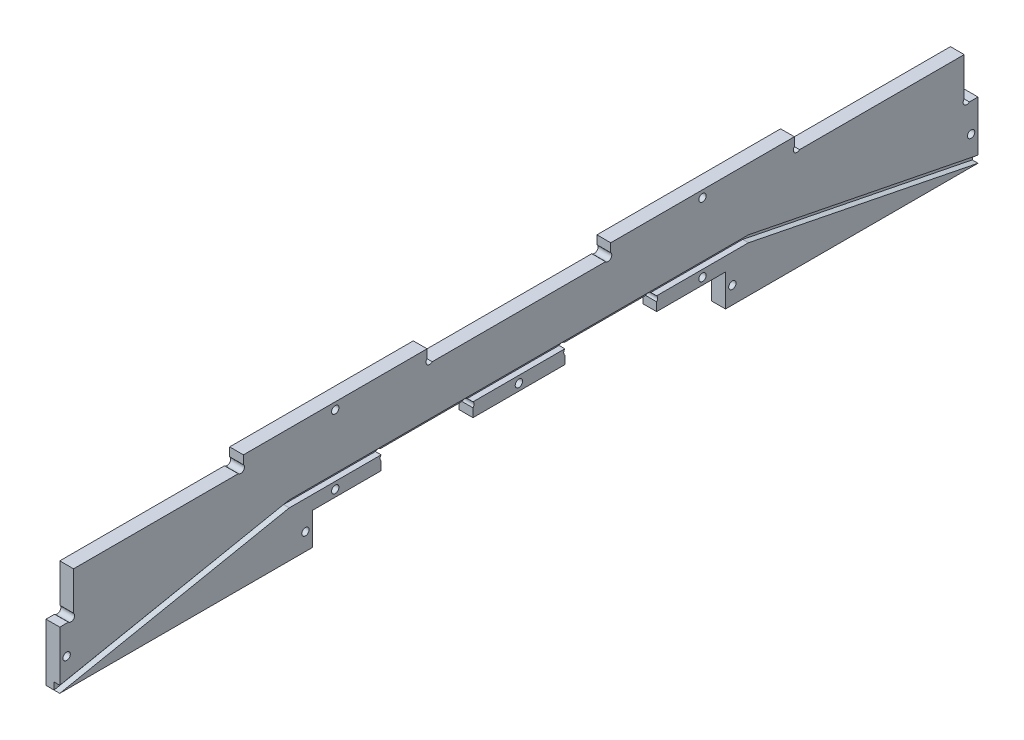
ISO-10303-21;
HEADER;
FILE_DESCRIPTION(('STEP AP214'),'2;1');
FILE_NAME('part.step','',(''),(''),'','','');
FILE_SCHEMA(('AUTOMOTIVE_DESIGN { 1 0 10303 214 1 1 1 1 }'));
ENDSEC;
DATA;
#1=APPLICATION_CONTEXT('core data for automotive mechanical design processes');
#2=APPLICATION_PROTOCOL_DEFINITION('international standard','automotive_design',2000,#1);
#3=PRODUCT_CONTEXT('',#1,'mechanical');
#4=PRODUCT('Part','Part','',(#3));
#5=PRODUCT_RELATED_PRODUCT_CATEGORY('part','',(#4));
#6=PRODUCT_DEFINITION_FORMATION('','',#4);
#7=PRODUCT_DEFINITION_CONTEXT('part definition',#1,'design');
#8=PRODUCT_DEFINITION('design','',#6,#7);
#9=PRODUCT_DEFINITION_SHAPE('','',#8);
#10=(LENGTH_UNIT() NAMED_UNIT(*) SI_UNIT(.MILLI.,.METRE.));
#11=(NAMED_UNIT(*) PLANE_ANGLE_UNIT() SI_UNIT($,.RADIAN.));
#12=(NAMED_UNIT(*) SI_UNIT($,.STERADIAN.) SOLID_ANGLE_UNIT());
#13=UNCERTAINTY_MEASURE_WITH_UNIT(LENGTH_MEASURE(1.E-05),#10,'distance_accuracy_value','');
#14=(GEOMETRIC_REPRESENTATION_CONTEXT(3) GLOBAL_UNCERTAINTY_ASSIGNED_CONTEXT((#13)) GLOBAL_UNIT_ASSIGNED_CONTEXT((#10,
#11,#12)) REPRESENTATION_CONTEXT('',''));
#15=CARTESIAN_POINT('',(0.,0.,0.));
#16=DIRECTION('',(0.,0.,1.));
#17=DIRECTION('',(1.,0.,0.));
#18=AXIS2_PLACEMENT_3D('',#15,#16,#17);
#19=CARTESIAN_POINT('',(6.,45.1313708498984,-38.8686291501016));
#20=DIRECTION('',(1.,0.,0.));
#21=DIRECTION('',(0.,0.,-1.));
#22=AXIS2_PLACEMENT_3D('',#19,#20,#21);
#23=PLANE('',#22);
#24=DIRECTION('',(0.,0.,-1.));
#25=VECTOR('',#24,1.);
#26=CARTESIAN_POINT('',(6.,20.,100.));
#27=LINE('',#26,#25);
#28=CARTESIAN_POINT('',(6.,20.,20.));
#29=VERTEX_POINT('',#28);
#30=CARTESIAN_POINT('',(6.,20.,-20.));
#31=VERTEX_POINT('',#30);
#32=EDGE_CURVE('E701',#29,#31,#27,.T.);
#33=ORIENTED_EDGE('',*,*,#32,.F.);
#34=CARTESIAN_POINT('',(6.,18.8686291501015,21.1313708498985));
#35=DIRECTION('',(-1.,0.,0.));
#36=DIRECTION('',(0.,0.,1.));
#37=AXIS2_PLACEMENT_3D('',#34,#35,#36);
#38=CIRCLE('',#37,1.6);
#39=CARTESIAN_POINT('',(6.,17.737258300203,20.));
#40=VERTEX_POINT('',#39);
#41=EDGE_CURVE('E545',#29,#40,#38,.T.);
#42=ORIENTED_EDGE('',*,*,#41,.T.);
#43=DIRECTION('',(0.,-1.,0.));
#44=VECTOR('',#43,1.);
#45=CARTESIAN_POINT('',(6.,17.737258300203,20.));
#46=LINE('',#45,#44);
#47=CARTESIAN_POINT('',(6.,13.9999999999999,20.));
#48=VERTEX_POINT('',#47);
#49=EDGE_CURVE('E547',#40,#48,#46,.T.);
#50=ORIENTED_EDGE('',*,*,#49,.T.);
#51=DIRECTION('',(0.,0.,-1.));
#52=VECTOR('',#51,1.);
#53=CARTESIAN_POINT('',(6.,13.9999999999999,20.));
#54=LINE('',#53,#52);
#55=CARTESIAN_POINT('',(6.,13.9999999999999,-20.));
#56=VERTEX_POINT('',#55);
#57=EDGE_CURVE('E549',#48,#56,#54,.T.);
#58=ORIENTED_EDGE('',*,*,#57,.T.);
#59=DIRECTION('',(0.,1.,0.));
#60=VECTOR('',#59,1.);
#61=CARTESIAN_POINT('',(6.,17.737258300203,-20.));
#62=LINE('',#61,#60);
#63=CARTESIAN_POINT('',(6.,17.737258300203,-20.));
#64=VERTEX_POINT('',#63);
#65=EDGE_CURVE('E551',#56,#64,#62,.T.);
#66=ORIENTED_EDGE('',*,*,#65,.T.);
#67=CARTESIAN_POINT('',(6.,18.8686291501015,-21.1313708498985));
#68=DIRECTION('',(-1.,0.,0.));
#69=DIRECTION('',(0.,0.,-1.));
#70=AXIS2_PLACEMENT_3D('',#67,#68,#69);
#71=CIRCLE('',#70,1.6);
#72=EDGE_CURVE('E553',#64,#31,#71,.T.);
#73=ORIENTED_EDGE('',*,*,#72,.T.);
#74=EDGE_LOOP('',(#33,#42,#50,#58,#66,#73));
#75=FACE_BOUND('',#74,.T.);
#76=CARTESIAN_POINT('',(6.,16.9999999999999,0.));
#77=DIRECTION('',(1.,0.,0.));
#78=DIRECTION('',(0.,0.,-1.));
#79=AXIS2_PLACEMENT_3D('',#76,#77,#78);
#80=CIRCLE('',#79,1.6);
#81=CARTESIAN_POINT('',(6.,16.9999999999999,-1.6));
#82=VERTEX_POINT('',#81);
#83=EDGE_CURVE('E610',#82,#82,#80,.T.);
#84=ORIENTED_EDGE('',*,*,#83,.F.);
#85=EDGE_LOOP('',(#84));
#86=FACE_BOUND('',#85,.T.);
#87=ADVANCED_FACE('F37',(#75,#86),#23,.T.);
#88=CARTESIAN_POINT('',(6.,20.,100.));
#89=VERTEX_POINT('',#88);
#90=CARTESIAN_POINT('',(6.,20.,60.));
#91=VERTEX_POINT('',#90);
#92=EDGE_CURVE('E698',#89,#91,#27,.T.);
#93=ORIENTED_EDGE('',*,*,#92,.F.);
#94=DIRECTION('',(0.,0.196116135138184,-0.98058067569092));
#95=VECTOR('',#94,1.);
#96=CARTESIAN_POINT('',(6.,20.,100.));
#97=LINE('',#96,#95);
#98=CARTESIAN_POINT('',(6.,0.,200.));
#99=VERTEX_POINT('',#98);
#100=EDGE_CURVE('E682',#99,#89,#97,.T.);
#101=ORIENTED_EDGE('',*,*,#100,.F.);
#102=DIRECTION('',(0.,0.,-1.));
#103=VECTOR('',#102,1.);
#104=CARTESIAN_POINT('',(6.,0.,200.));
#105=LINE('',#104,#103);
#106=CARTESIAN_POINT('',(6.,0.,90.));
#107=VERTEX_POINT('',#106);
#108=EDGE_CURVE('E534',#99,#107,#105,.T.);
#109=ORIENTED_EDGE('',*,*,#108,.T.);
#110=DIRECTION('',(0.,1.,0.));
#111=VECTOR('',#110,1.);
#112=CARTESIAN_POINT('',(6.,13.9999999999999,90.));
#113=LINE('',#112,#111);
#114=CARTESIAN_POINT('',(6.,13.9999999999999,90.));
#115=VERTEX_POINT('',#114);
#116=EDGE_CURVE('E536',#107,#115,#113,.T.);
#117=ORIENTED_EDGE('',*,*,#116,.T.);
#118=DIRECTION('',(0.,0.,-1.));
#119=VECTOR('',#118,1.);
#120=CARTESIAN_POINT('',(6.,13.9999999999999,90.));
#121=LINE('',#120,#119);
#122=CARTESIAN_POINT('',(6.,13.9999999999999,60.));
#123=VERTEX_POINT('',#122);
#124=EDGE_CURVE('E538',#115,#123,#121,.T.);
#125=ORIENTED_EDGE('',*,*,#124,.T.);
#126=DIRECTION('',(0.,1.,0.));
#127=VECTOR('',#126,1.);
#128=CARTESIAN_POINT('',(6.,17.737258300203,60.));
#129=LINE('',#128,#127);
#130=CARTESIAN_POINT('',(6.,17.737258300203,60.));
#131=VERTEX_POINT('',#130);
#132=EDGE_CURVE('E540',#123,#131,#129,.T.);
#133=ORIENTED_EDGE('',*,*,#132,.T.);
#134=CARTESIAN_POINT('',(6.,18.8686291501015,58.8686291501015));
#135=DIRECTION('',(-1.,0.,0.));
#136=DIRECTION('',(0.,0.,-1.));
#137=AXIS2_PLACEMENT_3D('',#134,#135,#136);
#138=CIRCLE('',#137,1.6);
#139=EDGE_CURVE('E542',#131,#91,#138,.T.);
#140=ORIENTED_EDGE('',*,*,#139,.T.);
#141=EDGE_LOOP('',(#93,#101,#109,#117,#125,#133,#140));
#142=FACE_BOUND('',#141,.T.);
#143=CARTESIAN_POINT('',(6.,7.49999999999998,93.));
#144=DIRECTION('',(1.,0.,0.));
#145=DIRECTION('',(0.,0.,1.));
#146=AXIS2_PLACEMENT_3D('',#143,#144,#145);
#147=CIRCLE('',#146,1.6);
#148=CARTESIAN_POINT('',(6.,7.49999999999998,94.6));
#149=VERTEX_POINT('',#148);
#150=EDGE_CURVE('E622',#149,#149,#147,.T.);
#151=ORIENTED_EDGE('',*,*,#150,.F.);
#152=EDGE_LOOP('',(#151));
#153=FACE_BOUND('',#152,.T.);
#154=CARTESIAN_POINT('',(6.,17.,80.));
#155=DIRECTION('',(1.,0.,0.));
#156=DIRECTION('',(0.,0.,-1.));
#157=AXIS2_PLACEMENT_3D('',#154,#155,#156);
#158=CIRCLE('',#157,1.6);
#159=CARTESIAN_POINT('',(6.,17.,78.4));
#160=VERTEX_POINT('',#159);
#161=EDGE_CURVE('E634',#160,#160,#158,.T.);
#162=ORIENTED_EDGE('',*,*,#161,.F.);
#163=EDGE_LOOP('',(#162));
#164=FACE_BOUND('',#163,.T.);
#165=ADVANCED_FACE('F870',(#142,#153,#164),#23,.T.);
#166=DIRECTION('',(0.,-0.195555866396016,0.980692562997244));
#167=VECTOR('',#166,1.);
#168=CARTESIAN_POINT('',(6.,23.,100.));
#169=LINE('',#168,#167);
#170=CARTESIAN_POINT('',(6.,23.,100.));
#171=VERTEX_POINT('',#170);
#172=CARTESIAN_POINT('',(6.,3.05941170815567,200.));
#173=VERTEX_POINT('',#172);
#174=EDGE_CURVE('E686',#171,#173,#169,.T.);
#175=ORIENTED_EDGE('',*,*,#174,.F.);
#176=DIRECTION('',(0.,0.,1.));
#177=VECTOR('',#176,1.);
#178=CARTESIAN_POINT('',(6.,23.,100.));
#179=LINE('',#178,#177);
#180=CARTESIAN_POINT('',(6.,23.,-100.));
#181=VERTEX_POINT('',#180);
#182=EDGE_CURVE('E689',#181,#171,#179,.T.);
#183=ORIENTED_EDGE('',*,*,#182,.F.);
#184=DIRECTION('',(0.,0.195555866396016,0.980692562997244));
#185=VECTOR('',#184,1.);
#186=CARTESIAN_POINT('',(6.,23.,-100.));
#187=LINE('',#186,#185);
#188=CARTESIAN_POINT('',(6.,3.05941170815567,-200.));
#189=VERTEX_POINT('',#188);
#190=EDGE_CURVE('E692',#189,#181,#187,.T.);
#191=ORIENTED_EDGE('',*,*,#190,.F.);
#192=DIRECTION('',(0.,1.,0.));
#193=VECTOR('',#192,1.);
#194=CARTESIAN_POINT('',(6.,25.,-200.));
#195=LINE('',#194,#193);
#196=CARTESIAN_POINT('',(6.,25.,-200.));
#197=VERTEX_POINT('',#196);
#198=EDGE_CURVE('E567',#189,#197,#195,.T.);
#199=ORIENTED_EDGE('',*,*,#198,.T.);
#200=DIRECTION('',(0.,0.,1.));
#201=VECTOR('',#200,1.);
#202=CARTESIAN_POINT('',(6.,25.,-196.262741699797));
#203=LINE('',#202,#201);
#204=CARTESIAN_POINT('',(6.,25.,-196.262741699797));
#205=VERTEX_POINT('',#204);
#206=EDGE_CURVE('E569',#197,#205,#203,.T.);
#207=ORIENTED_EDGE('',*,*,#206,.T.);
#208=CARTESIAN_POINT('',(6.,26.1313708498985,-195.131370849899));
#209=DIRECTION('',(-1.,0.,0.));
#210=DIRECTION('',(0.,0.,-1.));
#211=AXIS2_PLACEMENT_3D('',#208,#209,#210);
#212=CIRCLE('',#211,1.60000000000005);
#213=CARTESIAN_POINT('',(6.,27.262741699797,-194.));
#214=VERTEX_POINT('',#213);
#215=EDGE_CURVE('E571',#205,#214,#212,.T.);
#216=ORIENTED_EDGE('',*,*,#215,.T.);
#217=DIRECTION('',(0.,1.,0.));
#218=VECTOR('',#217,1.);
#219=CARTESIAN_POINT('',(6.,44.,-194.));
#220=LINE('',#219,#218);
#221=CARTESIAN_POINT('',(6.,44.,-194.));
#222=VERTEX_POINT('',#221);
#223=EDGE_CURVE('E573',#214,#222,#220,.T.);
#224=ORIENTED_EDGE('',*,*,#223,.T.);
#225=DIRECTION('',(0.,0.,1.));
#226=VECTOR('',#225,1.);
#227=CARTESIAN_POINT('',(6.,44.,-122.262741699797));
#228=LINE('',#227,#226);
#229=CARTESIAN_POINT('',(6.,44.,-122.262741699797));
#230=VERTEX_POINT('',#229);
#231=EDGE_CURVE('E575',#222,#230,#228,.T.);
#232=ORIENTED_EDGE('',*,*,#231,.T.);
#233=CARTESIAN_POINT('',(6.,45.1313708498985,-121.131370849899));
#234=DIRECTION('',(-1.,0.,0.));
#235=DIRECTION('',(0.,0.,1.));
#236=AXIS2_PLACEMENT_3D('',#233,#234,#235);
#237=CIRCLE('',#236,1.60000000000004);
#238=CARTESIAN_POINT('',(6.,46.262741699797,-120.));
#239=VERTEX_POINT('',#238);
#240=EDGE_CURVE('E289',#230,#239,#237,.T.);
#241=ORIENTED_EDGE('',*,*,#240,.T.);
#242=DIRECTION('',(0.,1.,0.));
#243=VECTOR('',#242,1.);
#244=CARTESIAN_POINT('',(6.,50.,-120.));
#245=LINE('',#244,#243);
#246=CARTESIAN_POINT('',(6.,50.,-120.));
#247=VERTEX_POINT('',#246);
#248=EDGE_CURVE('E280',#239,#247,#245,.T.);
#249=ORIENTED_EDGE('',*,*,#248,.T.);
#250=DIRECTION('',(0.,0.,1.));
#251=VECTOR('',#250,1.);
#252=CARTESIAN_POINT('',(6.,50.,-40.));
#253=LINE('',#252,#251);
#254=CARTESIAN_POINT('',(6.,50.,-40.));
#255=VERTEX_POINT('',#254);
#256=EDGE_CURVE('E286',#247,#255,#253,.T.);
#257=ORIENTED_EDGE('',*,*,#256,.T.);
#258=DIRECTION('',(0.,-1.,0.));
#259=VECTOR('',#258,1.);
#260=CARTESIAN_POINT('',(6.,46.2627416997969,-40.));
#261=LINE('',#260,#259);
#262=CARTESIAN_POINT('',(6.,46.2627416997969,-40.));
#263=VERTEX_POINT('',#262);
#264=EDGE_CURVE('E61',#255,#263,#261,.T.);
#265=ORIENTED_EDGE('',*,*,#264,.T.);
#266=CARTESIAN_POINT('',(6.,45.1313708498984,-38.8686291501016));
#267=DIRECTION('',(-1.,0.,0.));
#268=DIRECTION('',(0.,0.,-1.));
#269=AXIS2_PLACEMENT_3D('',#266,#267,#268);
#270=CIRCLE('',#269,1.59999999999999);
#271=CARTESIAN_POINT('',(6.,44.,-37.737258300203));
#272=VERTEX_POINT('',#271);
#273=EDGE_CURVE('E392',#263,#272,#270,.T.);
#274=ORIENTED_EDGE('',*,*,#273,.T.);
#275=DIRECTION('',(0.,0.,1.));
#276=VECTOR('',#275,1.);
#277=CARTESIAN_POINT('',(6.,44.,37.737258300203));
#278=LINE('',#277,#276);
#279=CARTESIAN_POINT('',(6.,44.,37.737258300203));
#280=VERTEX_POINT('',#279);
#281=EDGE_CURVE('E193',#272,#280,#278,.T.);
#282=ORIENTED_EDGE('',*,*,#281,.T.);
#283=CARTESIAN_POINT('',(6.,45.1313708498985,38.8686291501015));
#284=DIRECTION('',(-1.,0.,0.));
#285=DIRECTION('',(0.,0.,1.));
#286=AXIS2_PLACEMENT_3D('',#283,#284,#285);
#287=CIRCLE('',#286,1.60000000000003);
#288=CARTESIAN_POINT('',(6.,46.262741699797,40.));
#289=VERTEX_POINT('',#288);
#290=EDGE_CURVE('E513',#280,#289,#287,.T.);
#291=ORIENTED_EDGE('',*,*,#290,.T.);
#292=DIRECTION('',(0.,1.,0.));
#293=VECTOR('',#292,1.);
#294=CARTESIAN_POINT('',(6.,46.262741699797,40.));
#295=LINE('',#294,#293);
#296=CARTESIAN_POINT('',(6.,50.,40.));
#297=VERTEX_POINT('',#296);
#298=EDGE_CURVE('E510',#289,#297,#295,.T.);
#299=ORIENTED_EDGE('',*,*,#298,.T.);
#300=DIRECTION('',(0.,0.,1.));
#301=VECTOR('',#300,1.);
#302=CARTESIAN_POINT('',(6.,50.,40.));
#303=LINE('',#302,#301);
#304=CARTESIAN_POINT('',(6.,50.,120.));
#305=VERTEX_POINT('',#304);
#306=EDGE_CURVE('E512',#297,#305,#303,.T.);
#307=ORIENTED_EDGE('',*,*,#306,.T.);
#308=DIRECTION('',(0.,-1.,0.));
#309=VECTOR('',#308,1.);
#310=CARTESIAN_POINT('',(6.,50.,120.));
#311=LINE('',#310,#309);
#312=CARTESIAN_POINT('',(6.,46.262741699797,120.));
#313=VERTEX_POINT('',#312);
#314=EDGE_CURVE('E515',#305,#313,#311,.T.);
#315=ORIENTED_EDGE('',*,*,#314,.T.);
#316=CARTESIAN_POINT('',(6.,45.1313708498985,121.131370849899));
#317=DIRECTION('',(-1.,0.,0.));
#318=DIRECTION('',(0.,0.,-1.));
#319=AXIS2_PLACEMENT_3D('',#316,#317,#318);
#320=CIRCLE('',#319,1.60000000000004);
#321=CARTESIAN_POINT('',(6.,44.,122.262741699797));
#322=VERTEX_POINT('',#321);
#323=EDGE_CURVE('E521',#313,#322,#320,.T.);
#324=ORIENTED_EDGE('',*,*,#323,.T.);
#325=DIRECTION('',(0.,0.,1.));
#326=VECTOR('',#325,1.);
#327=CARTESIAN_POINT('',(6.,44.,122.262741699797));
#328=LINE('',#327,#326);
#329=CARTESIAN_POINT('',(6.,44.,194.));
#330=VERTEX_POINT('',#329);
#331=EDGE_CURVE('E523',#322,#330,#328,.T.);
#332=ORIENTED_EDGE('',*,*,#331,.T.);
#333=DIRECTION('',(0.,-1.,0.));
#334=VECTOR('',#333,1.);
#335=CARTESIAN_POINT('',(6.,44.,194.));
#336=LINE('',#335,#334);
#337=CARTESIAN_POINT('',(6.,27.2627416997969,194.));
#338=VERTEX_POINT('',#337);
#339=EDGE_CURVE('E525',#330,#338,#336,.T.);
#340=ORIENTED_EDGE('',*,*,#339,.T.);
#341=CARTESIAN_POINT('',(6.,26.1313708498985,195.131370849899));
#342=DIRECTION('',(-1.,0.,0.));
#343=DIRECTION('',(0.,0.,1.));
#344=AXIS2_PLACEMENT_3D('',#341,#342,#343);
#345=CIRCLE('',#344,1.60000000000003);
#346=CARTESIAN_POINT('',(6.,25.,196.262741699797));
#347=VERTEX_POINT('',#346);
#348=EDGE_CURVE('E527',#338,#347,#345,.T.);
#349=ORIENTED_EDGE('',*,*,#348,.T.);
#350=DIRECTION('',(0.,0.,1.));
#351=VECTOR('',#350,1.);
#352=CARTESIAN_POINT('',(6.,25.,196.262741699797));
#353=LINE('',#352,#351);
#354=CARTESIAN_POINT('',(6.,25.,200.));
#355=VERTEX_POINT('',#354);
#356=EDGE_CURVE('E529',#347,#355,#353,.T.);
#357=ORIENTED_EDGE('',*,*,#356,.T.);
#358=DIRECTION('',(0.,-1.,0.));
#359=VECTOR('',#358,1.);
#360=CARTESIAN_POINT('',(6.,25.,200.));
#361=LINE('',#360,#359);
#362=EDGE_CURVE('E531',#355,#173,#361,.T.);
#363=ORIENTED_EDGE('',*,*,#362,.T.);
#364=EDGE_LOOP('',(#175,#183,#191,#199,#207,#216,#224,#232,#241,#249,#257,#265,#274,#282,#291,
#299,#307,#315,#324,#332,#340,#349,#357,#363));
#365=FACE_BOUND('',#364,.T.);
#366=CARTESIAN_POINT('',(6.,12.5,-197.));
#367=DIRECTION('',(1.,0.,0.));
#368=DIRECTION('',(0.,0.,-1.));
#369=AXIS2_PLACEMENT_3D('',#366,#367,#368);
#370=CIRCLE('',#369,1.59999999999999);
#371=CARTESIAN_POINT('',(6.,12.5,-198.6));
#372=VERTEX_POINT('',#371);
#373=EDGE_CURVE('E598',#372,#372,#370,.T.);
#374=ORIENTED_EDGE('',*,*,#373,.F.);
#375=EDGE_LOOP('',(#374));
#376=FACE_BOUND('',#375,.T.);
#377=CARTESIAN_POINT('',(6.,47.,-80.));
#378=DIRECTION('',(1.,0.,0.));
#379=DIRECTION('',(0.,0.,-1.));
#380=AXIS2_PLACEMENT_3D('',#377,#378,#379);
#381=CIRCLE('',#380,1.60000000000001);
#382=CARTESIAN_POINT('',(6.,47.,-81.6));
#383=VERTEX_POINT('',#382);
#384=EDGE_CURVE('E314',#383,#383,#381,.T.);
#385=ORIENTED_EDGE('',*,*,#384,.F.);
#386=EDGE_LOOP('',(#385));
#387=FACE_BOUND('',#386,.T.);
#388=CARTESIAN_POINT('',(6.,47.,80.));
#389=DIRECTION('',(1.,0.,0.));
#390=DIRECTION('',(0.,0.,1.));
#391=AXIS2_PLACEMENT_3D('',#388,#389,#390);
#392=CIRCLE('',#391,1.60000000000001);
#393=CARTESIAN_POINT('',(6.,47.,81.6));
#394=VERTEX_POINT('',#393);
#395=EDGE_CURVE('E592',#394,#394,#392,.T.);
#396=ORIENTED_EDGE('',*,*,#395,.F.);
#397=EDGE_LOOP('',(#396));
#398=FACE_BOUND('',#397,.T.);
#399=CARTESIAN_POINT('',(6.,12.5,197.));
#400=DIRECTION('',(1.,0.,0.));
#401=DIRECTION('',(0.,0.,1.));
#402=AXIS2_PLACEMENT_3D('',#399,#400,#401);
#403=CIRCLE('',#402,1.59999999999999);
#404=CARTESIAN_POINT('',(6.,12.5,198.6));
#405=VERTEX_POINT('',#404);
#406=EDGE_CURVE('E604',#405,#405,#403,.T.);
#407=ORIENTED_EDGE('',*,*,#406,.F.);
#408=EDGE_LOOP('',(#407));
#409=FACE_BOUND('',#408,.T.);
#410=ADVANCED_FACE('F283',(#365,#376,#387,#398,#409),#23,.T.);
#411=CARTESIAN_POINT('',(6.,20.,-60.));
#412=VERTEX_POINT('',#411);
#413=CARTESIAN_POINT('',(6.,20.,-100.));
#414=VERTEX_POINT('',#413);
#415=EDGE_CURVE('E702',#412,#414,#27,.T.);
#416=ORIENTED_EDGE('',*,*,#415,.F.);
#417=CARTESIAN_POINT('',(6.,18.8686291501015,-58.8686291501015));
#418=DIRECTION('',(-1.,0.,0.));
#419=DIRECTION('',(0.,0.,1.));
#420=AXIS2_PLACEMENT_3D('',#417,#418,#419);
#421=CIRCLE('',#420,1.6);
#422=CARTESIAN_POINT('',(6.,17.737258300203,-60.));
#423=VERTEX_POINT('',#422);
#424=EDGE_CURVE('E556',#412,#423,#421,.T.);
#425=ORIENTED_EDGE('',*,*,#424,.T.);
#426=DIRECTION('',(0.,-1.,0.));
#427=VECTOR('',#426,1.);
#428=CARTESIAN_POINT('',(6.,17.737258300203,-60.));
#429=LINE('',#428,#427);
#430=CARTESIAN_POINT('',(6.,13.9999999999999,-60.));
#431=VERTEX_POINT('',#430);
#432=EDGE_CURVE('E558',#423,#431,#429,.T.);
#433=ORIENTED_EDGE('',*,*,#432,.T.);
#434=DIRECTION('',(0.,0.,-1.));
#435=VECTOR('',#434,1.);
#436=CARTESIAN_POINT('',(6.,13.9999999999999,-60.));
#437=LINE('',#436,#435);
#438=CARTESIAN_POINT('',(6.,13.9999999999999,-90.));
#439=VERTEX_POINT('',#438);
#440=EDGE_CURVE('E560',#431,#439,#437,.T.);
#441=ORIENTED_EDGE('',*,*,#440,.T.);
#442=DIRECTION('',(0.,-1.,0.));
#443=VECTOR('',#442,1.);
#444=CARTESIAN_POINT('',(6.,13.9999999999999,-90.));
#445=LINE('',#444,#443);
#446=CARTESIAN_POINT('',(6.,0.,-90.));
#447=VERTEX_POINT('',#446);
#448=EDGE_CURVE('E562',#439,#447,#445,.T.);
#449=ORIENTED_EDGE('',*,*,#448,.T.);
#450=DIRECTION('',(0.,0.,-1.));
#451=VECTOR('',#450,1.);
#452=CARTESIAN_POINT('',(6.,0.,-90.));
#453=LINE('',#452,#451);
#454=CARTESIAN_POINT('',(6.,0.,-200.));
#455=VERTEX_POINT('',#454);
#456=EDGE_CURVE('E564',#447,#455,#453,.T.);
#457=ORIENTED_EDGE('',*,*,#456,.T.);
#458=DIRECTION('',(0.,-0.196116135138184,-0.98058067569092));
#459=VECTOR('',#458,1.);
#460=CARTESIAN_POINT('',(6.,20.,-100.));
#461=LINE('',#460,#459);
#462=EDGE_CURVE('E695',#414,#455,#461,.T.);
#463=ORIENTED_EDGE('',*,*,#462,.F.);
#464=EDGE_LOOP('',(#416,#425,#433,#441,#449,#457,#463));
#465=FACE_BOUND('',#464,.T.);
#466=CARTESIAN_POINT('',(6.,17.,-80.));
#467=DIRECTION('',(1.,0.,0.));
#468=DIRECTION('',(0.,0.,1.));
#469=AXIS2_PLACEMENT_3D('',#466,#467,#468);
#470=CIRCLE('',#469,1.6);
#471=CARTESIAN_POINT('',(6.,17.,-78.4));
#472=VERTEX_POINT('',#471);
#473=EDGE_CURVE('E628',#472,#472,#470,.T.);
#474=ORIENTED_EDGE('',*,*,#473,.F.);
#475=EDGE_LOOP('',(#474));
#476=FACE_BOUND('',#475,.T.);
#477=CARTESIAN_POINT('',(6.,7.49999999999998,-93.));
#478=DIRECTION('',(1.,0.,0.));
#479=DIRECTION('',(0.,0.,-1.));
#480=AXIS2_PLACEMENT_3D('',#477,#478,#479);
#481=CIRCLE('',#480,1.6);
#482=CARTESIAN_POINT('',(6.,7.49999999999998,-94.6));
#483=VERTEX_POINT('',#482);
#484=EDGE_CURVE('E616',#483,#483,#481,.T.);
#485=ORIENTED_EDGE('',*,*,#484,.F.);
#486=EDGE_LOOP('',(#485));
#487=FACE_BOUND('',#486,.T.);
#488=ADVANCED_FACE('F872',(#465,#476,#487),#23,.T.);
#489=CARTESIAN_POINT('',(0.,45.1313708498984,-38.8686291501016));
#490=DIRECTION('',(1.,0.,0.));
#491=DIRECTION('',(0.,0.,-1.));
#492=AXIS2_PLACEMENT_3D('',#489,#490,#491);
#493=PLANE('',#492);
#494=CARTESIAN_POINT('',(0.,17.,-80.));
#495=DIRECTION('',(1.,0.,0.));
#496=DIRECTION('',(0.,0.,1.));
#497=AXIS2_PLACEMENT_3D('',#494,#495,#496);
#498=CIRCLE('',#497,1.6);
#499=CARTESIAN_POINT('',(0.,17.,-78.4));
#500=VERTEX_POINT('',#499);
#501=EDGE_CURVE('E631',#500,#500,#498,.T.);
#502=ORIENTED_EDGE('',*,*,#501,.T.);
#503=EDGE_LOOP('',(#502));
#504=FACE_BOUND('',#503,.T.);
#505=CARTESIAN_POINT('',(0.,7.49999999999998,-93.));
#506=DIRECTION('',(1.,0.,0.));
#507=DIRECTION('',(0.,0.,-1.));
#508=AXIS2_PLACEMENT_3D('',#505,#506,#507);
#509=CIRCLE('',#508,1.6);
#510=CARTESIAN_POINT('',(0.,7.49999999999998,-94.6));
#511=VERTEX_POINT('',#510);
#512=EDGE_CURVE('E619',#511,#511,#509,.T.);
#513=ORIENTED_EDGE('',*,*,#512,.T.);
#514=EDGE_LOOP('',(#513));
#515=FACE_BOUND('',#514,.T.);
#516=CARTESIAN_POINT('',(0.,12.5,197.));
#517=DIRECTION('',(1.,0.,0.));
#518=DIRECTION('',(0.,0.,1.));
#519=AXIS2_PLACEMENT_3D('',#516,#517,#518);
#520=CIRCLE('',#519,1.59999999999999);
#521=CARTESIAN_POINT('',(0.,12.5,198.6));
#522=VERTEX_POINT('',#521);
#523=EDGE_CURVE('E607',#522,#522,#520,.T.);
#524=ORIENTED_EDGE('',*,*,#523,.T.);
#525=EDGE_LOOP('',(#524));
#526=FACE_BOUND('',#525,.T.);
#527=CARTESIAN_POINT('',(0.,47.,80.));
#528=DIRECTION('',(1.,0.,0.));
#529=DIRECTION('',(0.,0.,1.));
#530=AXIS2_PLACEMENT_3D('',#527,#528,#529);
#531=CIRCLE('',#530,1.60000000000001);
#532=CARTESIAN_POINT('',(0.,47.,81.6));
#533=VERTEX_POINT('',#532);
#534=EDGE_CURVE('E595',#533,#533,#531,.T.);
#535=ORIENTED_EDGE('',*,*,#534,.T.);
#536=EDGE_LOOP('',(#535));
#537=FACE_BOUND('',#536,.T.);
#538=CARTESIAN_POINT('',(0.,45.1313708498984,-38.8686291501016));
#539=DIRECTION('',(-1.,0.,0.));
#540=DIRECTION('',(0.,0.,-1.));
#541=AXIS2_PLACEMENT_3D('',#538,#539,#540);
#542=CIRCLE('',#541,1.59999999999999);
#543=CARTESIAN_POINT('',(0.,46.2627416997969,-40.));
#544=VERTEX_POINT('',#543);
#545=CARTESIAN_POINT('',(0.,44.,-37.737258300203));
#546=VERTEX_POINT('',#545);
#547=EDGE_CURVE('E310',#544,#546,#542,.T.);
#548=ORIENTED_EDGE('',*,*,#547,.F.);
#549=DIRECTION('',(0.,-1.,0.));
#550=VECTOR('',#549,1.);
#551=CARTESIAN_POINT('',(0.,46.2627416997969,-40.));
#552=LINE('',#551,#550);
#553=CARTESIAN_POINT('',(0.,50.,-40.));
#554=VERTEX_POINT('',#553);
#555=EDGE_CURVE('E184',#554,#544,#552,.T.);
#556=ORIENTED_EDGE('',*,*,#555,.F.);
#557=DIRECTION('',(0.,0.,1.));
#558=VECTOR('',#557,1.);
#559=CARTESIAN_POINT('',(0.,50.,-40.));
#560=LINE('',#559,#558);
#561=CARTESIAN_POINT('',(0.,50.,-120.));
#562=VERTEX_POINT('',#561);
#563=EDGE_CURVE('E389',#562,#554,#560,.T.);
#564=ORIENTED_EDGE('',*,*,#563,.F.);
#565=DIRECTION('',(0.,1.,0.));
#566=VECTOR('',#565,1.);
#567=CARTESIAN_POINT('',(0.,50.,-120.));
#568=LINE('',#567,#566);
#569=CARTESIAN_POINT('',(0.,46.262741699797,-120.));
#570=VERTEX_POINT('',#569);
#571=EDGE_CURVE('E298',#570,#562,#568,.T.);
#572=ORIENTED_EDGE('',*,*,#571,.F.);
#573=CARTESIAN_POINT('',(0.,45.1313708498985,-121.131370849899));
#574=DIRECTION('',(-1.,0.,0.));
#575=DIRECTION('',(0.,0.,1.));
#576=AXIS2_PLACEMENT_3D('',#573,#574,#575);
#577=CIRCLE('',#576,1.60000000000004);
#578=CARTESIAN_POINT('',(0.,44.,-122.262741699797));
#579=VERTEX_POINT('',#578);
#580=EDGE_CURVE('E386',#579,#570,#577,.T.);
#581=ORIENTED_EDGE('',*,*,#580,.F.);
#582=DIRECTION('',(0.,0.,1.));
#583=VECTOR('',#582,1.);
#584=CARTESIAN_POINT('',(0.,44.,-122.262741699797));
#585=LINE('',#584,#583);
#586=CARTESIAN_POINT('',(0.,44.,-194.));
#587=VERTEX_POINT('',#586);
#588=EDGE_CURVE('E384',#587,#579,#585,.T.);
#589=ORIENTED_EDGE('',*,*,#588,.F.);
#590=DIRECTION('',(0.,1.,0.));
#591=VECTOR('',#590,1.);
#592=CARTESIAN_POINT('',(0.,44.,-194.));
#593=LINE('',#592,#591);
#594=CARTESIAN_POINT('',(0.,27.262741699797,-194.));
#595=VERTEX_POINT('',#594);
#596=EDGE_CURVE('E382',#595,#587,#593,.T.);
#597=ORIENTED_EDGE('',*,*,#596,.F.);
#598=CARTESIAN_POINT('',(0.,26.1313708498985,-195.131370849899));
#599=DIRECTION('',(-1.,0.,0.));
#600=DIRECTION('',(0.,0.,-1.));
#601=AXIS2_PLACEMENT_3D('',#598,#599,#600);
#602=CIRCLE('',#601,1.60000000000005);
#603=CARTESIAN_POINT('',(0.,25.,-196.262741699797));
#604=VERTEX_POINT('',#603);
#605=EDGE_CURVE('E380',#604,#595,#602,.T.);
#606=ORIENTED_EDGE('',*,*,#605,.F.);
#607=DIRECTION('',(0.,0.,1.));
#608=VECTOR('',#607,1.);
#609=CARTESIAN_POINT('',(0.,25.,-196.262741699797));
#610=LINE('',#609,#608);
#611=CARTESIAN_POINT('',(0.,25.,-200.));
#612=VERTEX_POINT('',#611);
#613=EDGE_CURVE('E378',#612,#604,#610,.T.);
#614=ORIENTED_EDGE('',*,*,#613,.F.);
#615=DIRECTION('',(0.,1.,0.));
#616=VECTOR('',#615,1.);
#617=CARTESIAN_POINT('',(0.,25.,-200.));
#618=LINE('',#617,#616);
#619=CARTESIAN_POINT('',(0.,0.,-200.));
#620=VERTEX_POINT('',#619);
#621=EDGE_CURVE('E376',#620,#612,#618,.T.);
#622=ORIENTED_EDGE('',*,*,#621,.F.);
#623=DIRECTION('',(0.,0.,-1.));
#624=VECTOR('',#623,1.);
#625=CARTESIAN_POINT('',(0.,0.,-90.));
#626=LINE('',#625,#624);
#627=CARTESIAN_POINT('',(0.,0.,-90.));
#628=VERTEX_POINT('',#627);
#629=EDGE_CURVE('E373',#628,#620,#626,.T.);
#630=ORIENTED_EDGE('',*,*,#629,.F.);
#631=DIRECTION('',(0.,-1.,0.));
#632=VECTOR('',#631,1.);
#633=CARTESIAN_POINT('',(0.,13.9999999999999,-90.));
#634=LINE('',#633,#632);
#635=CARTESIAN_POINT('',(0.,13.9999999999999,-90.));
#636=VERTEX_POINT('',#635);
#637=EDGE_CURVE('E371',#636,#628,#634,.T.);
#638=ORIENTED_EDGE('',*,*,#637,.F.);
#639=DIRECTION('',(0.,0.,-1.));
#640=VECTOR('',#639,1.);
#641=CARTESIAN_POINT('',(0.,13.9999999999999,-60.));
#642=LINE('',#641,#640);
#643=CARTESIAN_POINT('',(0.,13.9999999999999,-60.));
#644=VERTEX_POINT('',#643);
#645=EDGE_CURVE('E369',#644,#636,#642,.T.);
#646=ORIENTED_EDGE('',*,*,#645,.F.);
#647=DIRECTION('',(0.,-1.,0.));
#648=VECTOR('',#647,1.);
#649=CARTESIAN_POINT('',(0.,17.737258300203,-60.));
#650=LINE('',#649,#648);
#651=CARTESIAN_POINT('',(0.,17.737258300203,-60.));
#652=VERTEX_POINT('',#651);
#653=EDGE_CURVE('E367',#652,#644,#650,.T.);
#654=ORIENTED_EDGE('',*,*,#653,.F.);
#655=CARTESIAN_POINT('',(0.,18.8686291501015,-58.8686291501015));
#656=DIRECTION('',(-1.,0.,0.));
#657=DIRECTION('',(0.,0.,1.));
#658=AXIS2_PLACEMENT_3D('',#655,#656,#657);
#659=CIRCLE('',#658,1.6);
#660=CARTESIAN_POINT('',(0.,20.,-57.737258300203));
#661=VERTEX_POINT('',#660);
#662=EDGE_CURVE('E365',#661,#652,#659,.T.);
#663=ORIENTED_EDGE('',*,*,#662,.F.);
#664=DIRECTION('',(0.,0.,-1.));
#665=VECTOR('',#664,1.);
#666=CARTESIAN_POINT('',(0.,20.,-22.262741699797));
#667=LINE('',#666,#665);
#668=CARTESIAN_POINT('',(0.,20.,-22.262741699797));
#669=VERTEX_POINT('',#668);
#670=EDGE_CURVE('E362',#669,#661,#667,.T.);
#671=ORIENTED_EDGE('',*,*,#670,.F.);
#672=CARTESIAN_POINT('',(0.,18.8686291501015,-21.1313708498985));
#673=DIRECTION('',(-1.,0.,0.));
#674=DIRECTION('',(0.,0.,-1.));
#675=AXIS2_PLACEMENT_3D('',#672,#673,#674);
#676=CIRCLE('',#675,1.6);
#677=CARTESIAN_POINT('',(0.,17.737258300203,-20.));
#678=VERTEX_POINT('',#677);
#679=EDGE_CURVE('E359',#678,#669,#676,.T.);
#680=ORIENTED_EDGE('',*,*,#679,.F.);
#681=DIRECTION('',(0.,1.,0.));
#682=VECTOR('',#681,1.);
#683=CARTESIAN_POINT('',(0.,17.737258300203,-20.));
#684=LINE('',#683,#682);
#685=CARTESIAN_POINT('',(0.,13.9999999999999,-20.));
#686=VERTEX_POINT('',#685);
#687=EDGE_CURVE('E357',#686,#678,#684,.T.);
#688=ORIENTED_EDGE('',*,*,#687,.F.);
#689=DIRECTION('',(0.,0.,-1.));
#690=VECTOR('',#689,1.);
#691=CARTESIAN_POINT('',(0.,13.9999999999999,20.));
#692=LINE('',#691,#690);
#693=CARTESIAN_POINT('',(0.,13.9999999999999,20.));
#694=VERTEX_POINT('',#693);
#695=EDGE_CURVE('E355',#694,#686,#692,.T.);
#696=ORIENTED_EDGE('',*,*,#695,.F.);
#697=DIRECTION('',(0.,-1.,0.));
#698=VECTOR('',#697,1.);
#699=CARTESIAN_POINT('',(0.,17.737258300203,20.));
#700=LINE('',#699,#698);
#701=CARTESIAN_POINT('',(0.,17.737258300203,20.));
#702=VERTEX_POINT('',#701);
#703=EDGE_CURVE('E353',#702,#694,#700,.T.);
#704=ORIENTED_EDGE('',*,*,#703,.F.);
#705=CARTESIAN_POINT('',(0.,18.8686291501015,21.1313708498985));
#706=DIRECTION('',(-1.,0.,0.));
#707=DIRECTION('',(0.,0.,1.));
#708=AXIS2_PLACEMENT_3D('',#705,#706,#707);
#709=CIRCLE('',#708,1.6);
#710=CARTESIAN_POINT('',(0.,20.,22.262741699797));
#711=VERTEX_POINT('',#710);
#712=EDGE_CURVE('E351',#711,#702,#709,.T.);
#713=ORIENTED_EDGE('',*,*,#712,.F.);
#714=DIRECTION('',(0.,0.,-1.));
#715=VECTOR('',#714,1.);
#716=CARTESIAN_POINT('',(0.,20.,22.262741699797));
#717=LINE('',#716,#715);
#718=CARTESIAN_POINT('',(0.,20.,57.737258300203));
#719=VERTEX_POINT('',#718);
#720=EDGE_CURVE('E348',#719,#711,#717,.T.);
#721=ORIENTED_EDGE('',*,*,#720,.F.);
#722=CARTESIAN_POINT('',(0.,18.8686291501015,58.8686291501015));
#723=DIRECTION('',(-1.,0.,0.));
#724=DIRECTION('',(0.,0.,-1.));
#725=AXIS2_PLACEMENT_3D('',#722,#723,#724);
#726=CIRCLE('',#725,1.6);
#727=CARTESIAN_POINT('',(0.,17.737258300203,60.));
#728=VERTEX_POINT('',#727);
#729=EDGE_CURVE('E345',#728,#719,#726,.T.);
#730=ORIENTED_EDGE('',*,*,#729,.F.);
#731=DIRECTION('',(0.,1.,0.));
#732=VECTOR('',#731,1.);
#733=CARTESIAN_POINT('',(0.,17.737258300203,60.));
#734=LINE('',#733,#732);
#735=CARTESIAN_POINT('',(0.,13.9999999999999,60.));
#736=VERTEX_POINT('',#735);
#737=EDGE_CURVE('E343',#736,#728,#734,.T.);
#738=ORIENTED_EDGE('',*,*,#737,.F.);
#739=DIRECTION('',(0.,0.,-1.));
#740=VECTOR('',#739,1.);
#741=CARTESIAN_POINT('',(0.,13.9999999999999,90.));
#742=LINE('',#741,#740);
#743=CARTESIAN_POINT('',(0.,13.9999999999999,90.));
#744=VERTEX_POINT('',#743);
#745=EDGE_CURVE('E341',#744,#736,#742,.T.);
#746=ORIENTED_EDGE('',*,*,#745,.F.);
#747=DIRECTION('',(0.,1.,0.));
#748=VECTOR('',#747,1.);
#749=CARTESIAN_POINT('',(0.,13.9999999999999,90.));
#750=LINE('',#749,#748);
#751=CARTESIAN_POINT('',(0.,0.,90.));
#752=VERTEX_POINT('',#751);
#753=EDGE_CURVE('E339',#752,#744,#750,.T.);
#754=ORIENTED_EDGE('',*,*,#753,.F.);
#755=DIRECTION('',(0.,0.,-1.));
#756=VECTOR('',#755,1.);
#757=CARTESIAN_POINT('',(0.,0.,200.));
#758=LINE('',#757,#756);
#759=CARTESIAN_POINT('',(0.,0.,200.));
#760=VERTEX_POINT('',#759);
#761=EDGE_CURVE('E337',#760,#752,#758,.T.);
#762=ORIENTED_EDGE('',*,*,#761,.F.);
#763=DIRECTION('',(0.,-1.,0.));
#764=VECTOR('',#763,1.);
#765=CARTESIAN_POINT('',(0.,25.,200.));
#766=LINE('',#765,#764);
#767=CARTESIAN_POINT('',(0.,25.,200.));
#768=VERTEX_POINT('',#767);
#769=EDGE_CURVE('E334',#768,#760,#766,.T.);
#770=ORIENTED_EDGE('',*,*,#769,.F.);
#771=DIRECTION('',(0.,0.,1.));
#772=VECTOR('',#771,1.);
#773=CARTESIAN_POINT('',(0.,25.,196.262741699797));
#774=LINE('',#773,#772);
#775=CARTESIAN_POINT('',(0.,25.,196.262741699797));
#776=VERTEX_POINT('',#775);
#777=EDGE_CURVE('E332',#776,#768,#774,.T.);
#778=ORIENTED_EDGE('',*,*,#777,.F.);
#779=CARTESIAN_POINT('',(0.,26.1313708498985,195.131370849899));
#780=DIRECTION('',(-1.,0.,0.));
#781=DIRECTION('',(0.,0.,1.));
#782=AXIS2_PLACEMENT_3D('',#779,#780,#781);
#783=CIRCLE('',#782,1.60000000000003);
#784=CARTESIAN_POINT('',(0.,27.2627416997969,194.));
#785=VERTEX_POINT('',#784);
#786=EDGE_CURVE('E330',#785,#776,#783,.T.);
#787=ORIENTED_EDGE('',*,*,#786,.F.);
#788=DIRECTION('',(0.,-1.,0.));
#789=VECTOR('',#788,1.);
#790=CARTESIAN_POINT('',(0.,44.,194.));
#791=LINE('',#790,#789);
#792=CARTESIAN_POINT('',(0.,44.,194.));
#793=VERTEX_POINT('',#792);
#794=EDGE_CURVE('E328',#793,#785,#791,.T.);
#795=ORIENTED_EDGE('',*,*,#794,.F.);
#796=DIRECTION('',(0.,0.,1.));
#797=VECTOR('',#796,1.);
#798=CARTESIAN_POINT('',(0.,44.,122.262741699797));
#799=LINE('',#798,#797);
#800=CARTESIAN_POINT('',(0.,44.,122.262741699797));
#801=VERTEX_POINT('',#800);
#802=EDGE_CURVE('E326',#801,#793,#799,.T.);
#803=ORIENTED_EDGE('',*,*,#802,.F.);
#804=CARTESIAN_POINT('',(0.,45.1313708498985,121.131370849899));
#805=DIRECTION('',(-1.,0.,0.));
#806=DIRECTION('',(0.,0.,-1.));
#807=AXIS2_PLACEMENT_3D('',#804,#805,#806);
#808=CIRCLE('',#807,1.60000000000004);
#809=CARTESIAN_POINT('',(0.,46.262741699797,120.));
#810=VERTEX_POINT('',#809);
#811=EDGE_CURVE('E324',#810,#801,#808,.T.);
#812=ORIENTED_EDGE('',*,*,#811,.F.);
#813=DIRECTION('',(0.,-1.,0.));
#814=VECTOR('',#813,1.);
#815=CARTESIAN_POINT('',(0.,50.,120.));
#816=LINE('',#815,#814);
#817=CARTESIAN_POINT('',(0.,50.,120.));
#818=VERTEX_POINT('',#817);
#819=EDGE_CURVE('E322',#818,#810,#816,.T.);
#820=ORIENTED_EDGE('',*,*,#819,.F.);
#821=DIRECTION('',(0.,0.,1.));
#822=VECTOR('',#821,1.);
#823=CARTESIAN_POINT('',(0.,50.,40.));
#824=LINE('',#823,#822);
#825=CARTESIAN_POINT('',(0.,50.,40.));
#826=VERTEX_POINT('',#825);
#827=EDGE_CURVE('E320',#826,#818,#824,.T.);
#828=ORIENTED_EDGE('',*,*,#827,.F.);
#829=DIRECTION('',(0.,1.,0.));
#830=VECTOR('',#829,1.);
#831=CARTESIAN_POINT('',(0.,46.262741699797,40.));
#832=LINE('',#831,#830);
#833=CARTESIAN_POINT('',(0.,46.262741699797,40.));
#834=VERTEX_POINT('',#833);
#835=EDGE_CURVE('E318',#834,#826,#832,.T.);
#836=ORIENTED_EDGE('',*,*,#835,.F.);
#837=CARTESIAN_POINT('',(0.,45.1313708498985,38.8686291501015));
#838=DIRECTION('',(-1.,0.,0.));
#839=DIRECTION('',(0.,0.,1.));
#840=AXIS2_PLACEMENT_3D('',#837,#838,#839);
#841=CIRCLE('',#840,1.60000000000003);
#842=CARTESIAN_POINT('',(0.,44.,37.737258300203));
#843=VERTEX_POINT('',#842);
#844=EDGE_CURVE('E316',#843,#834,#841,.T.);
#845=ORIENTED_EDGE('',*,*,#844,.F.);
#846=DIRECTION('',(0.,0.,1.));
#847=VECTOR('',#846,1.);
#848=CARTESIAN_POINT('',(0.,44.,37.737258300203));
#849=LINE('',#848,#847);
#850=EDGE_CURVE('E313',#546,#843,#849,.T.);
#851=ORIENTED_EDGE('',*,*,#850,.F.);
#852=EDGE_LOOP('',(#548,#556,#564,#572,#581,#589,#597,#606,#614,#622,#630,#638,#646,#654,#663,
#671,#680,#688,#696,#704,#713,#721,#730,#738,#746,#754,#762,#770,#778,#787,#795,#803,#812,#820,
#828,#836,#845,#851));
#853=FACE_BOUND('',#852,.T.);
#854=CARTESIAN_POINT('',(0.,47.,-80.));
#855=DIRECTION('',(1.,0.,0.));
#856=DIRECTION('',(0.,0.,-1.));
#857=AXIS2_PLACEMENT_3D('',#854,#855,#856);
#858=CIRCLE('',#857,1.60000000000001);
#859=CARTESIAN_POINT('',(0.,47.,-81.6));
#860=VERTEX_POINT('',#859);
#861=EDGE_CURVE('E589',#860,#860,#858,.T.);
#862=ORIENTED_EDGE('',*,*,#861,.T.);
#863=EDGE_LOOP('',(#862));
#864=FACE_BOUND('',#863,.T.);
#865=CARTESIAN_POINT('',(0.,12.5,-197.));
#866=DIRECTION('',(1.,0.,0.));
#867=DIRECTION('',(0.,0.,-1.));
#868=AXIS2_PLACEMENT_3D('',#865,#866,#867);
#869=CIRCLE('',#868,1.59999999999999);
#870=CARTESIAN_POINT('',(0.,12.5,-198.6));
#871=VERTEX_POINT('',#870);
#872=EDGE_CURVE('E601',#871,#871,#869,.T.);
#873=ORIENTED_EDGE('',*,*,#872,.T.);
#874=EDGE_LOOP('',(#873));
#875=FACE_BOUND('',#874,.T.);
#876=CARTESIAN_POINT('',(0.,16.9999999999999,0.));
#877=DIRECTION('',(1.,0.,0.));
#878=DIRECTION('',(0.,0.,-1.));
#879=AXIS2_PLACEMENT_3D('',#876,#877,#878);
#880=CIRCLE('',#879,1.6);
#881=CARTESIAN_POINT('',(0.,16.9999999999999,-1.6));
#882=VERTEX_POINT('',#881);
#883=EDGE_CURVE('E613',#882,#882,#880,.T.);
#884=ORIENTED_EDGE('',*,*,#883,.T.);
#885=EDGE_LOOP('',(#884));
#886=FACE_BOUND('',#885,.T.);
#887=CARTESIAN_POINT('',(0.,7.49999999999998,93.));
#888=DIRECTION('',(1.,0.,0.));
#889=DIRECTION('',(0.,0.,1.));
#890=AXIS2_PLACEMENT_3D('',#887,#888,#889);
#891=CIRCLE('',#890,1.6);
#892=CARTESIAN_POINT('',(0.,7.49999999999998,94.6));
#893=VERTEX_POINT('',#892);
#894=EDGE_CURVE('E625',#893,#893,#891,.T.);
#895=ORIENTED_EDGE('',*,*,#894,.T.);
#896=EDGE_LOOP('',(#895));
#897=FACE_BOUND('',#896,.T.);
#898=CARTESIAN_POINT('',(0.,17.,80.));
#899=DIRECTION('',(1.,0.,0.));
#900=DIRECTION('',(0.,0.,-1.));
#901=AXIS2_PLACEMENT_3D('',#898,#899,#900);
#902=CIRCLE('',#901,1.6);
#903=CARTESIAN_POINT('',(0.,17.,78.4));
#904=VERTEX_POINT('',#903);
#905=EDGE_CURVE('E637',#904,#904,#902,.T.);
#906=ORIENTED_EDGE('',*,*,#905,.T.);
#907=EDGE_LOOP('',(#906));
#908=FACE_BOUND('',#907,.T.);
#909=ADVANCED_FACE('F497',(#504,#515,#526,#537,#853,#864,#875,#886,#897,#908),#493,.F.);
#910=CARTESIAN_POINT('',(6.,45.1313708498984,-38.8686291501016));
#911=DIRECTION('',(-1.,0.,0.));
#912=DIRECTION('',(0.,0.,1.));
#913=AXIS2_PLACEMENT_3D('',#910,#911,#912);
#914=CYLINDRICAL_SURFACE('',#913,1.59999999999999);
#915=ORIENTED_EDGE('',*,*,#547,.T.);
#916=DIRECTION('',(-1.,0.,0.));
#917=VECTOR('',#916,1.);
#918=CARTESIAN_POINT('',(6.,44.,-37.737258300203));
#919=LINE('',#918,#917);
#920=EDGE_CURVE('E45',#272,#546,#919,.T.);
#921=ORIENTED_EDGE('',*,*,#920,.F.);
#922=ORIENTED_EDGE('',*,*,#273,.F.);
#923=DIRECTION('',(-1.,0.,0.));
#924=VECTOR('',#923,1.);
#925=CARTESIAN_POINT('',(6.,46.2627416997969,-40.));
#926=LINE('',#925,#924);
#927=EDGE_CURVE('E306',#263,#544,#926,.T.);
#928=ORIENTED_EDGE('',*,*,#927,.T.);
#929=EDGE_LOOP('',(#915,#921,#922,#928));
#930=FACE_BOUND('',#929,.T.);
#931=ADVANCED_FACE('F39',(#930),#914,.F.);
#932=CARTESIAN_POINT('',(6.,44.,37.737258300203));
#933=DIRECTION('',(0.,-1.,0.));
#934=DIRECTION('',(0.,0.,-1.));
#935=AXIS2_PLACEMENT_3D('',#932,#933,#934);
#936=PLANE('',#935);
#937=ORIENTED_EDGE('',*,*,#850,.T.);
#938=DIRECTION('',(-1.,0.,0.));
#939=VECTOR('',#938,1.);
#940=CARTESIAN_POINT('',(6.,44.,37.737258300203));
#941=LINE('',#940,#939);
#942=EDGE_CURVE('E489',#280,#843,#941,.T.);
#943=ORIENTED_EDGE('',*,*,#942,.F.);
#944=ORIENTED_EDGE('',*,*,#281,.F.);
#945=ORIENTED_EDGE('',*,*,#920,.T.);
#946=EDGE_LOOP('',(#937,#943,#944,#945));
#947=FACE_BOUND('',#946,.T.);
#948=ADVANCED_FACE('F492',(#947),#936,.F.);
#949=CARTESIAN_POINT('',(6.,45.1313708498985,38.8686291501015));
#950=DIRECTION('',(-1.,0.,0.));
#951=DIRECTION('',(0.,0.,1.));
#952=AXIS2_PLACEMENT_3D('',#949,#950,#951);
#953=CYLINDRICAL_SURFACE('',#952,1.60000000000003);
#954=ORIENTED_EDGE('',*,*,#844,.T.);
#955=DIRECTION('',(-1.,0.,0.));
#956=VECTOR('',#955,1.);
#957=CARTESIAN_POINT('',(6.,46.262741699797,40.));
#958=LINE('',#957,#956);
#959=EDGE_CURVE('E486',#289,#834,#958,.T.);
#960=ORIENTED_EDGE('',*,*,#959,.F.);
#961=ORIENTED_EDGE('',*,*,#290,.F.);
#962=ORIENTED_EDGE('',*,*,#942,.T.);
#963=EDGE_LOOP('',(#954,#960,#961,#962));
#964=FACE_BOUND('',#963,.T.);
#965=ADVANCED_FACE('F504',(#964),#953,.F.);
#966=CARTESIAN_POINT('',(6.,46.262741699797,40.));
#967=DIRECTION('',(0.,0.,1.));
#968=DIRECTION('',(1.,0.,0.));
#969=AXIS2_PLACEMENT_3D('',#966,#967,#968);
#970=PLANE('',#969);
#971=ORIENTED_EDGE('',*,*,#835,.T.);
#972=DIRECTION('',(-1.,0.,0.));
#973=VECTOR('',#972,1.);
#974=CARTESIAN_POINT('',(6.,50.,40.));
#975=LINE('',#974,#973);
#976=EDGE_CURVE('E483',#297,#826,#975,.T.);
#977=ORIENTED_EDGE('',*,*,#976,.F.);
#978=ORIENTED_EDGE('',*,*,#298,.F.);
#979=ORIENTED_EDGE('',*,*,#959,.T.);
#980=EDGE_LOOP('',(#971,#977,#978,#979));
#981=FACE_BOUND('',#980,.T.);
#982=ADVANCED_FACE('F508',(#981),#970,.F.);
#983=CARTESIAN_POINT('',(6.,50.,40.));
#984=DIRECTION('',(0.,-1.,0.));
#985=DIRECTION('',(0.,0.,-1.));
#986=AXIS2_PLACEMENT_3D('',#983,#984,#985);
#987=PLANE('',#986);
#988=ORIENTED_EDGE('',*,*,#827,.T.);
#989=DIRECTION('',(-1.,0.,0.));
#990=VECTOR('',#989,1.);
#991=CARTESIAN_POINT('',(6.,50.,120.));
#992=LINE('',#991,#990);
#993=EDGE_CURVE('E480',#305,#818,#992,.T.);
#994=ORIENTED_EDGE('',*,*,#993,.F.);
#995=ORIENTED_EDGE('',*,*,#306,.F.);
#996=ORIENTED_EDGE('',*,*,#976,.T.);
#997=EDGE_LOOP('',(#988,#994,#995,#996));
#998=FACE_BOUND('',#997,.T.);
#999=ADVANCED_FACE('F1101',(#998),#987,.F.);
#1000=CARTESIAN_POINT('',(6.,50.,120.));
#1001=DIRECTION('',(0.,0.,-1.));
#1002=DIRECTION('',(0.,1.,0.));
#1003=AXIS2_PLACEMENT_3D('',#1000,#1001,#1002);
#1004=PLANE('',#1003);
#1005=ORIENTED_EDGE('',*,*,#819,.T.);
#1006=DIRECTION('',(-1.,0.,0.));
#1007=VECTOR('',#1006,1.);
#1008=CARTESIAN_POINT('',(6.,46.262741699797,120.));
#1009=LINE('',#1008,#1007);
#1010=EDGE_CURVE('E477',#313,#810,#1009,.T.);
#1011=ORIENTED_EDGE('',*,*,#1010,.F.);
#1012=ORIENTED_EDGE('',*,*,#314,.F.);
#1013=ORIENTED_EDGE('',*,*,#993,.T.);
#1014=EDGE_LOOP('',(#1005,#1011,#1012,#1013));
#1015=FACE_BOUND('',#1014,.T.);
#1016=ADVANCED_FACE('F1098',(#1015),#1004,.F.);
#1017=CARTESIAN_POINT('',(6.,45.1313708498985,121.131370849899));
#1018=DIRECTION('',(-1.,0.,0.));
#1019=DIRECTION('',(0.,0.,1.));
#1020=AXIS2_PLACEMENT_3D('',#1017,#1018,#1019);
#1021=CYLINDRICAL_SURFACE('',#1020,1.60000000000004);
#1022=ORIENTED_EDGE('',*,*,#811,.T.);
#1023=DIRECTION('',(-1.,0.,0.));
#1024=VECTOR('',#1023,1.);
#1025=CARTESIAN_POINT('',(6.,44.,122.262741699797));
#1026=LINE('',#1025,#1024);
#1027=EDGE_CURVE('E474',#322,#801,#1026,.T.);
#1028=ORIENTED_EDGE('',*,*,#1027,.F.);
#1029=ORIENTED_EDGE('',*,*,#323,.F.);
#1030=ORIENTED_EDGE('',*,*,#1010,.T.);
#1031=EDGE_LOOP('',(#1022,#1028,#1029,#1030));
#1032=FACE_BOUND('',#1031,.T.);
#1033=ADVANCED_FACE('F1094',(#1032),#1021,.F.);
#1034=CARTESIAN_POINT('',(6.,44.,122.262741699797));
#1035=DIRECTION('',(0.,-1.,0.));
#1036=DIRECTION('',(0.,0.,-1.));
#1037=AXIS2_PLACEMENT_3D('',#1034,#1035,#1036);
#1038=PLANE('',#1037);
#1039=ORIENTED_EDGE('',*,*,#802,.T.);
#1040=DIRECTION('',(-1.,0.,0.));
#1041=VECTOR('',#1040,1.);
#1042=CARTESIAN_POINT('',(6.,44.,194.));
#1043=LINE('',#1042,#1041);
#1044=EDGE_CURVE('E471',#330,#793,#1043,.T.);
#1045=ORIENTED_EDGE('',*,*,#1044,.F.);
#1046=ORIENTED_EDGE('',*,*,#331,.F.);
#1047=ORIENTED_EDGE('',*,*,#1027,.T.);
#1048=EDGE_LOOP('',(#1039,#1045,#1046,#1047));
#1049=FACE_BOUND('',#1048,.T.);
#1050=ADVANCED_FACE('F1089',(#1049),#1038,.F.);
#1051=CARTESIAN_POINT('',(6.,44.,194.));
#1052=DIRECTION('',(0.,0.,-1.));
#1053=DIRECTION('',(-1.,0.,0.));
#1054=AXIS2_PLACEMENT_3D('',#1051,#1052,#1053);
#1055=PLANE('',#1054);
#1056=ORIENTED_EDGE('',*,*,#794,.T.);
#1057=DIRECTION('',(-1.,0.,0.));
#1058=VECTOR('',#1057,1.);
#1059=CARTESIAN_POINT('',(6.,27.2627416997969,194.));
#1060=LINE('',#1059,#1058);
#1061=EDGE_CURVE('E468',#338,#785,#1060,.T.);
#1062=ORIENTED_EDGE('',*,*,#1061,.F.);
#1063=ORIENTED_EDGE('',*,*,#339,.F.);
#1064=ORIENTED_EDGE('',*,*,#1044,.T.);
#1065=EDGE_LOOP('',(#1056,#1062,#1063,#1064));
#1066=FACE_BOUND('',#1065,.T.);
#1067=ADVANCED_FACE('F1083',(#1066),#1055,.F.);
#1068=CARTESIAN_POINT('',(6.,26.1313708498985,195.131370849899));
#1069=DIRECTION('',(-1.,0.,0.));
#1070=DIRECTION('',(0.,0.,1.));
#1071=AXIS2_PLACEMENT_3D('',#1068,#1069,#1070);
#1072=CYLINDRICAL_SURFACE('',#1071,1.60000000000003);
#1073=ORIENTED_EDGE('',*,*,#786,.T.);
#1074=DIRECTION('',(-1.,0.,0.));
#1075=VECTOR('',#1074,1.);
#1076=CARTESIAN_POINT('',(6.,25.,196.262741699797));
#1077=LINE('',#1076,#1075);
#1078=EDGE_CURVE('E465',#347,#776,#1077,.T.);
#1079=ORIENTED_EDGE('',*,*,#1078,.F.);
#1080=ORIENTED_EDGE('',*,*,#348,.F.);
#1081=ORIENTED_EDGE('',*,*,#1061,.T.);
#1082=EDGE_LOOP('',(#1073,#1079,#1080,#1081));
#1083=FACE_BOUND('',#1082,.T.);
#1084=ADVANCED_FACE('F1081',(#1083),#1072,.F.);
#1085=CARTESIAN_POINT('',(6.,25.,196.262741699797));
#1086=DIRECTION('',(0.,-1.,0.));
#1087=DIRECTION('',(0.,0.,-1.));
#1088=AXIS2_PLACEMENT_3D('',#1085,#1086,#1087);
#1089=PLANE('',#1088);
#1090=ORIENTED_EDGE('',*,*,#777,.T.);
#1091=DIRECTION('',(-1.,0.,0.));
#1092=VECTOR('',#1091,1.);
#1093=CARTESIAN_POINT('',(6.,25.,200.));
#1094=LINE('',#1093,#1092);
#1095=EDGE_CURVE('E462',#355,#768,#1094,.T.);
#1096=ORIENTED_EDGE('',*,*,#1095,.F.);
#1097=ORIENTED_EDGE('',*,*,#356,.F.);
#1098=ORIENTED_EDGE('',*,*,#1078,.T.);
#1099=EDGE_LOOP('',(#1090,#1096,#1097,#1098));
#1100=FACE_BOUND('',#1099,.T.);
#1101=ADVANCED_FACE('F1074',(#1100),#1089,.F.);
#1102=CARTESIAN_POINT('',(6.,25.,200.));
#1103=DIRECTION('',(0.,0.,-1.));
#1104=DIRECTION('',(0.,1.,0.));
#1105=AXIS2_PLACEMENT_3D('',#1102,#1103,#1104);
#1106=PLANE('',#1105);
#1107=DIRECTION('',(0.,-1.,0.));
#1108=VECTOR('',#1107,1.);
#1109=CARTESIAN_POINT('',(3.5,3.05941170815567,200.));
#1110=LINE('',#1109,#1108);
#1111=CARTESIAN_POINT('',(3.5,3.05941170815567,200.));
#1112=VERTEX_POINT('',#1111);
#1113=CARTESIAN_POINT('',(3.5,0.,200.));
#1114=VERTEX_POINT('',#1113);
#1115=EDGE_CURVE('E705',#1112,#1114,#1110,.T.);
#1116=ORIENTED_EDGE('',*,*,#1115,.F.);
#1117=DIRECTION('',(1.,0.,0.));
#1118=VECTOR('',#1117,1.);
#1119=CARTESIAN_POINT('',(3.5,3.05941170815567,200.));
#1120=LINE('',#1119,#1118);
#1121=EDGE_CURVE('E677',#1112,#173,#1120,.T.);
#1122=ORIENTED_EDGE('',*,*,#1121,.T.);
#1123=ORIENTED_EDGE('',*,*,#362,.F.);
#1124=ORIENTED_EDGE('',*,*,#1095,.T.);
#1125=ORIENTED_EDGE('',*,*,#769,.T.);
#1126=DIRECTION('',(-1.,0.,0.));
#1127=VECTOR('',#1126,1.);
#1128=CARTESIAN_POINT('',(6.,0.,200.));
#1129=LINE('',#1128,#1127);
#1130=EDGE_CURVE('E458',#1114,#760,#1129,.T.);
#1131=ORIENTED_EDGE('',*,*,#1130,.F.);
#1132=EDGE_LOOP('',(#1116,#1122,#1123,#1124,#1125,#1131));
#1133=FACE_BOUND('',#1132,.T.);
#1134=ADVANCED_FACE('F1042',(#1133),#1106,.F.);
#1135=CARTESIAN_POINT('',(6.,0.,200.));
#1136=DIRECTION('',(0.,1.,0.));
#1137=DIRECTION('',(0.,0.,1.));
#1138=AXIS2_PLACEMENT_3D('',#1135,#1136,#1137);
#1139=PLANE('',#1138);
#1140=ORIENTED_EDGE('',*,*,#761,.T.);
#1141=DIRECTION('',(-1.,0.,0.));
#1142=VECTOR('',#1141,1.);
#1143=CARTESIAN_POINT('',(6.,0.,90.));
#1144=LINE('',#1143,#1142);
#1145=EDGE_CURVE('E455',#107,#752,#1144,.T.);
#1146=ORIENTED_EDGE('',*,*,#1145,.F.);
#1147=ORIENTED_EDGE('',*,*,#108,.F.);
#1148=EDGE_CURVE('E459',#99,#1114,#1129,.T.);
#1149=ORIENTED_EDGE('',*,*,#1148,.T.);
#1150=ORIENTED_EDGE('',*,*,#1130,.T.);
#1151=EDGE_LOOP('',(#1140,#1146,#1147,#1149,#1150));
#1152=FACE_BOUND('',#1151,.T.);
#1153=ADVANCED_FACE('F1048',(#1152),#1139,.F.);
#1154=CARTESIAN_POINT('',(6.,13.9999999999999,90.));
#1155=DIRECTION('',(0.,0.,1.));
#1156=DIRECTION('',(0.,-1.,0.));
#1157=AXIS2_PLACEMENT_3D('',#1154,#1155,#1156);
#1158=PLANE('',#1157);
#1159=ORIENTED_EDGE('',*,*,#753,.T.);
#1160=DIRECTION('',(-1.,0.,0.));
#1161=VECTOR('',#1160,1.);
#1162=CARTESIAN_POINT('',(6.,13.9999999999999,90.));
#1163=LINE('',#1162,#1161);
#1164=EDGE_CURVE('E452',#115,#744,#1163,.T.);
#1165=ORIENTED_EDGE('',*,*,#1164,.F.);
#1166=ORIENTED_EDGE('',*,*,#116,.F.);
#1167=ORIENTED_EDGE('',*,*,#1145,.T.);
#1168=EDGE_LOOP('',(#1159,#1165,#1166,#1167));
#1169=FACE_BOUND('',#1168,.T.);
#1170=ADVANCED_FACE('F1068',(#1169),#1158,.F.);
#1171=CARTESIAN_POINT('',(6.,13.9999999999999,90.));
#1172=DIRECTION('',(0.,1.,0.));
#1173=DIRECTION('',(0.,0.,1.));
#1174=AXIS2_PLACEMENT_3D('',#1171,#1172,#1173);
#1175=PLANE('',#1174);
#1176=ORIENTED_EDGE('',*,*,#745,.T.);
#1177=DIRECTION('',(-1.,0.,0.));
#1178=VECTOR('',#1177,1.);
#1179=CARTESIAN_POINT('',(6.,13.9999999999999,60.));
#1180=LINE('',#1179,#1178);
#1181=EDGE_CURVE('E449',#123,#736,#1180,.T.);
#1182=ORIENTED_EDGE('',*,*,#1181,.F.);
#1183=ORIENTED_EDGE('',*,*,#124,.F.);
#1184=ORIENTED_EDGE('',*,*,#1164,.T.);
#1185=EDGE_LOOP('',(#1176,#1182,#1183,#1184));
#1186=FACE_BOUND('',#1185,.T.);
#1187=ADVANCED_FACE('F1064',(#1186),#1175,.F.);
#1188=CARTESIAN_POINT('',(6.,17.737258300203,60.));
#1189=DIRECTION('',(0.,0.,1.));
#1190=DIRECTION('',(0.,-1.,0.));
#1191=AXIS2_PLACEMENT_3D('',#1188,#1189,#1190);
#1192=PLANE('',#1191);
#1193=ORIENTED_EDGE('',*,*,#737,.T.);
#1194=DIRECTION('',(-1.,0.,0.));
#1195=VECTOR('',#1194,1.);
#1196=CARTESIAN_POINT('',(6.,17.737258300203,60.));
#1197=LINE('',#1196,#1195);
#1198=EDGE_CURVE('E446',#131,#728,#1197,.T.);
#1199=ORIENTED_EDGE('',*,*,#1198,.F.);
#1200=ORIENTED_EDGE('',*,*,#132,.F.);
#1201=ORIENTED_EDGE('',*,*,#1181,.T.);
#1202=EDGE_LOOP('',(#1193,#1199,#1200,#1201));
#1203=FACE_BOUND('',#1202,.T.);
#1204=ADVANCED_FACE('F1059',(#1203),#1192,.F.);
#1205=CARTESIAN_POINT('',(6.,18.8686291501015,58.8686291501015));
#1206=DIRECTION('',(-1.,0.,0.));
#1207=DIRECTION('',(0.,0.,1.));
#1208=AXIS2_PLACEMENT_3D('',#1205,#1206,#1207);
#1209=CYLINDRICAL_SURFACE('',#1208,1.6);
#1210=CARTESIAN_POINT('',(3.5,18.8686291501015,58.8686291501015));
#1211=DIRECTION('',(-1.,0.,0.));
#1212=DIRECTION('',(0.,0.,1.));
#1213=AXIS2_PLACEMENT_3D('',#1210,#1211,#1212);
#1214=CIRCLE('',#1213,1.6);
#1215=CARTESIAN_POINT('',(3.5,20.,57.737258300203));
#1216=VERTEX_POINT('',#1215);
#1217=CARTESIAN_POINT('',(3.5,20.,60.));
#1218=VERTEX_POINT('',#1217);
#1219=EDGE_CURVE('E651',#1216,#1218,#1214,.F.);
#1220=ORIENTED_EDGE('',*,*,#1219,.T.);
#1221=DIRECTION('',(-1.,0.,0.));
#1222=VECTOR('',#1221,1.);
#1223=CARTESIAN_POINT('',(6.,20.,60.));
#1224=LINE('',#1223,#1222);
#1225=EDGE_CURVE('E640',#1218,#91,#1224,.F.);
#1226=ORIENTED_EDGE('',*,*,#1225,.T.);
#1227=ORIENTED_EDGE('',*,*,#139,.F.);
#1228=ORIENTED_EDGE('',*,*,#1198,.T.);
#1229=ORIENTED_EDGE('',*,*,#729,.T.);
#1230=DIRECTION('',(-1.,0.,0.));
#1231=VECTOR('',#1230,1.);
#1232=CARTESIAN_POINT('',(6.,20.,57.737258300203));
#1233=LINE('',#1232,#1231);
#1234=EDGE_CURVE('E444',#1216,#719,#1233,.T.);
#1235=ORIENTED_EDGE('',*,*,#1234,.F.);
#1236=EDGE_LOOP('',(#1220,#1226,#1227,#1228,#1229,#1235));
#1237=FACE_BOUND('',#1236,.T.);
#1238=ADVANCED_FACE('F1053',(#1237),#1209,.F.);
#1239=CARTESIAN_POINT('',(6.,20.,22.262741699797));
#1240=DIRECTION('',(0.,1.,0.));
#1241=DIRECTION('',(0.,0.,1.));
#1242=AXIS2_PLACEMENT_3D('',#1239,#1240,#1241);
#1243=PLANE('',#1242);
#1244=DIRECTION('',(-1.,0.,0.));
#1245=VECTOR('',#1244,1.);
#1246=CARTESIAN_POINT('',(6.,20.,22.262741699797));
#1247=LINE('',#1246,#1245);
#1248=CARTESIAN_POINT('',(3.5,20.,22.2627416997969));
#1249=VERTEX_POINT('',#1248);
#1250=EDGE_CURVE('E442',#1249,#711,#1247,.T.);
#1251=ORIENTED_EDGE('',*,*,#1250,.F.);
#1252=DIRECTION('',(0.,0.,-1.));
#1253=VECTOR('',#1252,1.);
#1254=CARTESIAN_POINT('',(3.5,20.,100.));
#1255=LINE('',#1254,#1253);
#1256=EDGE_CURVE('E722',#1216,#1249,#1255,.T.);
#1257=ORIENTED_EDGE('',*,*,#1256,.F.);
#1258=ORIENTED_EDGE('',*,*,#1234,.T.);
#1259=ORIENTED_EDGE('',*,*,#720,.T.);
#1260=EDGE_LOOP('',(#1251,#1257,#1258,#1259));
#1261=FACE_BOUND('',#1260,.T.);
#1262=ADVANCED_FACE('F841',(#1261),#1243,.F.);
#1263=CARTESIAN_POINT('',(6.,18.8686291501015,21.1313708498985));
#1264=DIRECTION('',(-1.,0.,0.));
#1265=DIRECTION('',(0.,0.,1.));
#1266=AXIS2_PLACEMENT_3D('',#1263,#1264,#1265);
#1267=CYLINDRICAL_SURFACE('',#1266,1.6);
#1268=ORIENTED_EDGE('',*,*,#41,.F.);
#1269=DIRECTION('',(-1.,0.,0.));
#1270=VECTOR('',#1269,1.);
#1271=CARTESIAN_POINT('',(6.,20.,20.));
#1272=LINE('',#1271,#1270);
#1273=CARTESIAN_POINT('',(3.5,20.,20.));
#1274=VERTEX_POINT('',#1273);
#1275=EDGE_CURVE('E645',#29,#1274,#1272,.T.);
#1276=ORIENTED_EDGE('',*,*,#1275,.T.);
#1277=CARTESIAN_POINT('',(3.5,18.8686291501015,21.1313708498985));
#1278=DIRECTION('',(-1.,0.,0.));
#1279=DIRECTION('',(0.,0.,1.));
#1280=AXIS2_PLACEMENT_3D('',#1277,#1278,#1279);
#1281=CIRCLE('',#1280,1.6);
#1282=EDGE_CURVE('E654',#1274,#1249,#1281,.F.);
#1283=ORIENTED_EDGE('',*,*,#1282,.T.);
#1284=ORIENTED_EDGE('',*,*,#1250,.T.);
#1285=ORIENTED_EDGE('',*,*,#712,.T.);
#1286=DIRECTION('',(-1.,0.,0.));
#1287=VECTOR('',#1286,1.);
#1288=CARTESIAN_POINT('',(6.,17.737258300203,20.));
#1289=LINE('',#1288,#1287);
#1290=EDGE_CURVE('E439',#40,#702,#1289,.T.);
#1291=ORIENTED_EDGE('',*,*,#1290,.F.);
#1292=EDGE_LOOP('',(#1268,#1276,#1283,#1284,#1285,#1291));
#1293=FACE_BOUND('',#1292,.T.);
#1294=ADVANCED_FACE('F840',(#1293),#1267,.F.);
#1295=CARTESIAN_POINT('',(6.,17.737258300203,20.));
#1296=DIRECTION('',(0.,0.,-1.));
#1297=DIRECTION('',(0.,1.,0.));
#1298=AXIS2_PLACEMENT_3D('',#1295,#1296,#1297);
#1299=PLANE('',#1298);
#1300=ORIENTED_EDGE('',*,*,#703,.T.);
#1301=DIRECTION('',(-1.,0.,0.));
#1302=VECTOR('',#1301,1.);
#1303=CARTESIAN_POINT('',(6.,13.9999999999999,20.));
#1304=LINE('',#1303,#1302);
#1305=EDGE_CURVE('E436',#48,#694,#1304,.T.);
#1306=ORIENTED_EDGE('',*,*,#1305,.F.);
#1307=ORIENTED_EDGE('',*,*,#49,.F.);
#1308=ORIENTED_EDGE('',*,*,#1290,.T.);
#1309=EDGE_LOOP('',(#1300,#1306,#1307,#1308));
#1310=FACE_BOUND('',#1309,.T.);
#1311=ADVANCED_FACE('F850',(#1310),#1299,.F.);
#1312=CARTESIAN_POINT('',(6.,13.9999999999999,20.));
#1313=DIRECTION('',(0.,1.,0.));
#1314=DIRECTION('',(0.,0.,1.));
#1315=AXIS2_PLACEMENT_3D('',#1312,#1313,#1314);
#1316=PLANE('',#1315);
#1317=ORIENTED_EDGE('',*,*,#695,.T.);
#1318=DIRECTION('',(-1.,0.,0.));
#1319=VECTOR('',#1318,1.);
#1320=CARTESIAN_POINT('',(6.,13.9999999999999,-20.));
#1321=LINE('',#1320,#1319);
#1322=EDGE_CURVE('E433',#56,#686,#1321,.T.);
#1323=ORIENTED_EDGE('',*,*,#1322,.F.);
#1324=ORIENTED_EDGE('',*,*,#57,.F.);
#1325=ORIENTED_EDGE('',*,*,#1305,.T.);
#1326=EDGE_LOOP('',(#1317,#1323,#1324,#1325));
#1327=FACE_BOUND('',#1326,.T.);
#1328=ADVANCED_FACE('F1252',(#1327),#1316,.F.);
#1329=CARTESIAN_POINT('',(6.,17.737258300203,-20.));
#1330=DIRECTION('',(0.,0.,1.));
#1331=DIRECTION('',(0.,-1.,0.));
#1332=AXIS2_PLACEMENT_3D('',#1329,#1330,#1331);
#1333=PLANE('',#1332);
#1334=ORIENTED_EDGE('',*,*,#687,.T.);
#1335=DIRECTION('',(-1.,0.,0.));
#1336=VECTOR('',#1335,1.);
#1337=CARTESIAN_POINT('',(6.,17.737258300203,-20.));
#1338=LINE('',#1337,#1336);
#1339=EDGE_CURVE('E430',#64,#678,#1338,.T.);
#1340=ORIENTED_EDGE('',*,*,#1339,.F.);
#1341=ORIENTED_EDGE('',*,*,#65,.F.);
#1342=ORIENTED_EDGE('',*,*,#1322,.T.);
#1343=EDGE_LOOP('',(#1334,#1340,#1341,#1342));
#1344=FACE_BOUND('',#1343,.T.);
#1345=ADVANCED_FACE('F1260',(#1344),#1333,.F.);
#1346=CARTESIAN_POINT('',(6.,18.8686291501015,-21.1313708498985));
#1347=DIRECTION('',(-1.,0.,0.));
#1348=DIRECTION('',(0.,0.,1.));
#1349=AXIS2_PLACEMENT_3D('',#1346,#1347,#1348);
#1350=CYLINDRICAL_SURFACE('',#1349,1.6);
#1351=CARTESIAN_POINT('',(3.5,18.8686291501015,-21.1313708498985));
#1352=DIRECTION('',(-1.,0.,0.));
#1353=DIRECTION('',(0.,0.,1.));
#1354=AXIS2_PLACEMENT_3D('',#1351,#1352,#1353);
#1355=CIRCLE('',#1354,1.6);
#1356=CARTESIAN_POINT('',(3.5,20.,-22.262741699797));
#1357=VERTEX_POINT('',#1356);
#1358=CARTESIAN_POINT('',(3.5,20.,-20.));
#1359=VERTEX_POINT('',#1358);
#1360=EDGE_CURVE('E657',#1357,#1359,#1355,.F.);
#1361=ORIENTED_EDGE('',*,*,#1360,.T.);
#1362=DIRECTION('',(-1.,0.,0.));
#1363=VECTOR('',#1362,1.);
#1364=CARTESIAN_POINT('',(6.,20.,-20.));
#1365=LINE('',#1364,#1363);
#1366=EDGE_CURVE('E648',#1359,#31,#1365,.F.);
#1367=ORIENTED_EDGE('',*,*,#1366,.T.);
#1368=ORIENTED_EDGE('',*,*,#72,.F.);
#1369=ORIENTED_EDGE('',*,*,#1339,.T.);
#1370=ORIENTED_EDGE('',*,*,#679,.T.);
#1371=DIRECTION('',(-1.,0.,0.));
#1372=VECTOR('',#1371,1.);
#1373=CARTESIAN_POINT('',(6.,20.,-22.262741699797));
#1374=LINE('',#1373,#1372);
#1375=EDGE_CURVE('E428',#1357,#669,#1374,.T.);
#1376=ORIENTED_EDGE('',*,*,#1375,.F.);
#1377=EDGE_LOOP('',(#1361,#1367,#1368,#1369,#1370,#1376));
#1378=FACE_BOUND('',#1377,.T.);
#1379=ADVANCED_FACE('F750',(#1378),#1350,.F.);
#1380=CARTESIAN_POINT('',(6.,20.,-22.262741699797));
#1381=DIRECTION('',(0.,1.,0.));
#1382=DIRECTION('',(0.,0.,1.));
#1383=AXIS2_PLACEMENT_3D('',#1380,#1381,#1382);
#1384=PLANE('',#1383);
#1385=DIRECTION('',(-1.,0.,0.));
#1386=VECTOR('',#1385,1.);
#1387=CARTESIAN_POINT('',(6.,20.,-57.737258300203));
#1388=LINE('',#1387,#1386);
#1389=CARTESIAN_POINT('',(3.5,20.,-57.7372583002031));
#1390=VERTEX_POINT('',#1389);
#1391=EDGE_CURVE('E426',#1390,#661,#1388,.T.);
#1392=ORIENTED_EDGE('',*,*,#1391,.F.);
#1393=EDGE_CURVE('E728',#1357,#1390,#1255,.T.);
#1394=ORIENTED_EDGE('',*,*,#1393,.F.);
#1395=ORIENTED_EDGE('',*,*,#1375,.T.);
#1396=ORIENTED_EDGE('',*,*,#670,.T.);
#1397=EDGE_LOOP('',(#1392,#1394,#1395,#1396));
#1398=FACE_BOUND('',#1397,.T.);
#1399=ADVANCED_FACE('F758',(#1398),#1384,.F.);
#1400=CARTESIAN_POINT('',(6.,18.8686291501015,-58.8686291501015));
#1401=DIRECTION('',(-1.,0.,0.));
#1402=DIRECTION('',(0.,0.,1.));
#1403=AXIS2_PLACEMENT_3D('',#1400,#1401,#1402);
#1404=CYLINDRICAL_SURFACE('',#1403,1.6);
#1405=ORIENTED_EDGE('',*,*,#424,.F.);
#1406=DIRECTION('',(-1.,0.,0.));
#1407=VECTOR('',#1406,1.);
#1408=CARTESIAN_POINT('',(6.,20.,-60.));
#1409=LINE('',#1408,#1407);
#1410=CARTESIAN_POINT('',(3.5,20.,-60.));
#1411=VERTEX_POINT('',#1410);
#1412=EDGE_CURVE('E11',#412,#1411,#1409,.T.);
#1413=ORIENTED_EDGE('',*,*,#1412,.T.);
#1414=CARTESIAN_POINT('',(3.5,18.8686291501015,-58.8686291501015));
#1415=DIRECTION('',(-1.,0.,0.));
#1416=DIRECTION('',(0.,0.,1.));
#1417=AXIS2_PLACEMENT_3D('',#1414,#1415,#1416);
#1418=CIRCLE('',#1417,1.6);
#1419=EDGE_CURVE('E660',#1411,#1390,#1418,.F.);
#1420=ORIENTED_EDGE('',*,*,#1419,.T.);
#1421=ORIENTED_EDGE('',*,*,#1391,.T.);
#1422=ORIENTED_EDGE('',*,*,#662,.T.);
#1423=DIRECTION('',(-1.,0.,0.));
#1424=VECTOR('',#1423,1.);
#1425=CARTESIAN_POINT('',(6.,17.737258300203,-60.));
#1426=LINE('',#1425,#1424);
#1427=EDGE_CURVE('E423',#423,#652,#1426,.T.);
#1428=ORIENTED_EDGE('',*,*,#1427,.F.);
#1429=EDGE_LOOP('',(#1405,#1413,#1420,#1421,#1422,#1428));
#1430=FACE_BOUND('',#1429,.T.);
#1431=ADVANCED_FACE('F762',(#1430),#1404,.F.);
#1432=CARTESIAN_POINT('',(6.,17.737258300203,-60.));
#1433=DIRECTION('',(0.,0.,-1.));
#1434=DIRECTION('',(0.,1.,0.));
#1435=AXIS2_PLACEMENT_3D('',#1432,#1433,#1434);
#1436=PLANE('',#1435);
#1437=ORIENTED_EDGE('',*,*,#653,.T.);
#1438=DIRECTION('',(-1.,0.,0.));
#1439=VECTOR('',#1438,1.);
#1440=CARTESIAN_POINT('',(6.,13.9999999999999,-60.));
#1441=LINE('',#1440,#1439);
#1442=EDGE_CURVE('E420',#431,#644,#1441,.T.);
#1443=ORIENTED_EDGE('',*,*,#1442,.F.);
#1444=ORIENTED_EDGE('',*,*,#432,.F.);
#1445=ORIENTED_EDGE('',*,*,#1427,.T.);
#1446=EDGE_LOOP('',(#1437,#1443,#1444,#1445));
#1447=FACE_BOUND('',#1446,.T.);
#1448=ADVANCED_FACE('F1291',(#1447),#1436,.F.);
#1449=CARTESIAN_POINT('',(6.,13.9999999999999,-60.));
#1450=DIRECTION('',(0.,1.,0.));
#1451=DIRECTION('',(0.,0.,1.));
#1452=AXIS2_PLACEMENT_3D('',#1449,#1450,#1451);
#1453=PLANE('',#1452);
#1454=ORIENTED_EDGE('',*,*,#645,.T.);
#1455=DIRECTION('',(-1.,0.,0.));
#1456=VECTOR('',#1455,1.);
#1457=CARTESIAN_POINT('',(6.,13.9999999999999,-90.));
#1458=LINE('',#1457,#1456);
#1459=EDGE_CURVE('E417',#439,#636,#1458,.T.);
#1460=ORIENTED_EDGE('',*,*,#1459,.F.);
#1461=ORIENTED_EDGE('',*,*,#440,.F.);
#1462=ORIENTED_EDGE('',*,*,#1442,.T.);
#1463=EDGE_LOOP('',(#1454,#1460,#1461,#1462));
#1464=FACE_BOUND('',#1463,.T.);
#1465=ADVANCED_FACE('F1298',(#1464),#1453,.F.);
#1466=CARTESIAN_POINT('',(6.,13.9999999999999,-90.));
#1467=DIRECTION('',(0.,0.,-1.));
#1468=DIRECTION('',(0.,1.,0.));
#1469=AXIS2_PLACEMENT_3D('',#1466,#1467,#1468);
#1470=PLANE('',#1469);
#1471=ORIENTED_EDGE('',*,*,#637,.T.);
#1472=DIRECTION('',(-1.,0.,0.));
#1473=VECTOR('',#1472,1.);
#1474=CARTESIAN_POINT('',(6.,0.,-90.));
#1475=LINE('',#1474,#1473);
#1476=EDGE_CURVE('E414',#447,#628,#1475,.T.);
#1477=ORIENTED_EDGE('',*,*,#1476,.F.);
#1478=ORIENTED_EDGE('',*,*,#448,.F.);
#1479=ORIENTED_EDGE('',*,*,#1459,.T.);
#1480=EDGE_LOOP('',(#1471,#1477,#1478,#1479));
#1481=FACE_BOUND('',#1480,.T.);
#1482=ADVANCED_FACE('F1307',(#1481),#1470,.F.);
#1483=CARTESIAN_POINT('',(6.,0.,-90.));
#1484=DIRECTION('',(0.,1.,0.));
#1485=DIRECTION('',(0.,0.,1.));
#1486=AXIS2_PLACEMENT_3D('',#1483,#1484,#1485);
#1487=PLANE('',#1486);
#1488=ORIENTED_EDGE('',*,*,#629,.T.);
#1489=DIRECTION('',(-1.,0.,0.));
#1490=VECTOR('',#1489,1.);
#1491=CARTESIAN_POINT('',(6.,0.,-200.));
#1492=LINE('',#1491,#1490);
#1493=CARTESIAN_POINT('',(3.5,0.,-200.));
#1494=VERTEX_POINT('',#1493);
#1495=EDGE_CURVE('E411',#1494,#620,#1492,.T.);
#1496=ORIENTED_EDGE('',*,*,#1495,.F.);
#1497=EDGE_CURVE('E412',#455,#1494,#1492,.T.);
#1498=ORIENTED_EDGE('',*,*,#1497,.F.);
#1499=ORIENTED_EDGE('',*,*,#456,.F.);
#1500=ORIENTED_EDGE('',*,*,#1476,.T.);
#1501=EDGE_LOOP('',(#1488,#1496,#1498,#1499,#1500));
#1502=FACE_BOUND('',#1501,.T.);
#1503=ADVANCED_FACE('F787',(#1502),#1487,.F.);
#1504=CARTESIAN_POINT('',(6.,25.,-200.));
#1505=DIRECTION('',(0.,0.,1.));
#1506=DIRECTION('',(0.,-1.,0.));
#1507=AXIS2_PLACEMENT_3D('',#1504,#1505,#1506);
#1508=PLANE('',#1507);
#1509=ORIENTED_EDGE('',*,*,#198,.F.);
#1510=DIRECTION('',(1.,0.,0.));
#1511=VECTOR('',#1510,1.);
#1512=CARTESIAN_POINT('',(3.5,3.05941170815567,-200.));
#1513=LINE('',#1512,#1511);
#1514=CARTESIAN_POINT('',(3.5,3.05941170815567,-200.));
#1515=VERTEX_POINT('',#1514);
#1516=EDGE_CURVE('E667',#1515,#189,#1513,.T.);
#1517=ORIENTED_EDGE('',*,*,#1516,.F.);
#1518=DIRECTION('',(0.,1.,0.));
#1519=VECTOR('',#1518,1.);
#1520=CARTESIAN_POINT('',(3.5,3.05941170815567,-200.));
#1521=LINE('',#1520,#1519);
#1522=EDGE_CURVE('E717',#1494,#1515,#1521,.T.);
#1523=ORIENTED_EDGE('',*,*,#1522,.F.);
#1524=ORIENTED_EDGE('',*,*,#1495,.T.);
#1525=ORIENTED_EDGE('',*,*,#621,.T.);
#1526=DIRECTION('',(-1.,0.,0.));
#1527=VECTOR('',#1526,1.);
#1528=CARTESIAN_POINT('',(6.,25.,-200.));
#1529=LINE('',#1528,#1527);
#1530=EDGE_CURVE('E408',#197,#612,#1529,.T.);
#1531=ORIENTED_EDGE('',*,*,#1530,.F.);
#1532=EDGE_LOOP('',(#1509,#1517,#1523,#1524,#1525,#1531));
#1533=FACE_BOUND('',#1532,.T.);
#1534=ADVANCED_FACE('F786',(#1533),#1508,.F.);
#1535=CARTESIAN_POINT('',(6.,25.,-196.262741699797));
#1536=DIRECTION('',(0.,-1.,0.));
#1537=DIRECTION('',(0.,0.,-1.));
#1538=AXIS2_PLACEMENT_3D('',#1535,#1536,#1537);
#1539=PLANE('',#1538);
#1540=ORIENTED_EDGE('',*,*,#613,.T.);
#1541=DIRECTION('',(-1.,0.,0.));
#1542=VECTOR('',#1541,1.);
#1543=CARTESIAN_POINT('',(6.,25.,-196.262741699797));
#1544=LINE('',#1543,#1542);
#1545=EDGE_CURVE('E405',#205,#604,#1544,.T.);
#1546=ORIENTED_EDGE('',*,*,#1545,.F.);
#1547=ORIENTED_EDGE('',*,*,#206,.F.);
#1548=ORIENTED_EDGE('',*,*,#1530,.T.);
#1549=EDGE_LOOP('',(#1540,#1546,#1547,#1548));
#1550=FACE_BOUND('',#1549,.T.);
#1551=ADVANCED_FACE('F797',(#1550),#1539,.F.);
#1552=CARTESIAN_POINT('',(6.,26.1313708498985,-195.131370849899));
#1553=DIRECTION('',(-1.,0.,0.));
#1554=DIRECTION('',(0.,0.,1.));
#1555=AXIS2_PLACEMENT_3D('',#1552,#1553,#1554);
#1556=CYLINDRICAL_SURFACE('',#1555,1.60000000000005);
#1557=ORIENTED_EDGE('',*,*,#605,.T.);
#1558=DIRECTION('',(-1.,0.,0.));
#1559=VECTOR('',#1558,1.);
#1560=CARTESIAN_POINT('',(6.,27.262741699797,-194.));
#1561=LINE('',#1560,#1559);
#1562=EDGE_CURVE('E402',#214,#595,#1561,.T.);
#1563=ORIENTED_EDGE('',*,*,#1562,.F.);
#1564=ORIENTED_EDGE('',*,*,#215,.F.);
#1565=ORIENTED_EDGE('',*,*,#1545,.T.);
#1566=EDGE_LOOP('',(#1557,#1563,#1564,#1565));
#1567=FACE_BOUND('',#1566,.T.);
#1568=ADVANCED_FACE('F1333',(#1567),#1556,.F.);
#1569=CARTESIAN_POINT('',(6.,44.,-194.));
#1570=DIRECTION('',(0.,0.,1.));
#1571=DIRECTION('',(1.,0.,0.));
#1572=AXIS2_PLACEMENT_3D('',#1569,#1570,#1571);
#1573=PLANE('',#1572);
#1574=ORIENTED_EDGE('',*,*,#596,.T.);
#1575=DIRECTION('',(-1.,0.,0.));
#1576=VECTOR('',#1575,1.);
#1577=CARTESIAN_POINT('',(6.,44.,-194.));
#1578=LINE('',#1577,#1576);
#1579=EDGE_CURVE('E399',#222,#587,#1578,.T.);
#1580=ORIENTED_EDGE('',*,*,#1579,.F.);
#1581=ORIENTED_EDGE('',*,*,#223,.F.);
#1582=ORIENTED_EDGE('',*,*,#1562,.T.);
#1583=EDGE_LOOP('',(#1574,#1580,#1581,#1582));
#1584=FACE_BOUND('',#1583,.T.);
#1585=ADVANCED_FACE('F1341',(#1584),#1573,.F.);
#1586=CARTESIAN_POINT('',(6.,44.,-122.262741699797));
#1587=DIRECTION('',(0.,-1.,0.));
#1588=DIRECTION('',(0.,0.,-1.));
#1589=AXIS2_PLACEMENT_3D('',#1586,#1587,#1588);
#1590=PLANE('',#1589);
#1591=ORIENTED_EDGE('',*,*,#588,.T.);
#1592=DIRECTION('',(-1.,0.,0.));
#1593=VECTOR('',#1592,1.);
#1594=CARTESIAN_POINT('',(6.,44.,-122.262741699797));
#1595=LINE('',#1594,#1593);
#1596=EDGE_CURVE('E396',#230,#579,#1595,.T.);
#1597=ORIENTED_EDGE('',*,*,#1596,.F.);
#1598=ORIENTED_EDGE('',*,*,#231,.F.);
#1599=ORIENTED_EDGE('',*,*,#1579,.T.);
#1600=EDGE_LOOP('',(#1591,#1597,#1598,#1599));
#1601=FACE_BOUND('',#1600,.T.);
#1602=ADVANCED_FACE('F581',(#1601),#1590,.F.);
#1603=CARTESIAN_POINT('',(6.,45.1313708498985,-121.131370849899));
#1604=DIRECTION('',(-1.,0.,0.));
#1605=DIRECTION('',(0.,0.,1.));
#1606=AXIS2_PLACEMENT_3D('',#1603,#1604,#1605);
#1607=CYLINDRICAL_SURFACE('',#1606,1.60000000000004);
#1608=ORIENTED_EDGE('',*,*,#580,.T.);
#1609=DIRECTION('',(-1.,0.,0.));
#1610=VECTOR('',#1609,1.);
#1611=CARTESIAN_POINT('',(6.,46.262741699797,-120.));
#1612=LINE('',#1611,#1610);
#1613=EDGE_CURVE('E301',#239,#570,#1612,.T.);
#1614=ORIENTED_EDGE('',*,*,#1613,.F.);
#1615=ORIENTED_EDGE('',*,*,#240,.F.);
#1616=ORIENTED_EDGE('',*,*,#1596,.T.);
#1617=EDGE_LOOP('',(#1608,#1614,#1615,#1616));
#1618=FACE_BOUND('',#1617,.T.);
#1619=ADVANCED_FACE('F585',(#1618),#1607,.F.);
#1620=CARTESIAN_POINT('',(6.,50.,-120.));
#1621=DIRECTION('',(0.,0.,1.));
#1622=DIRECTION('',(0.,-1.,0.));
#1623=AXIS2_PLACEMENT_3D('',#1620,#1621,#1622);
#1624=PLANE('',#1623);
#1625=ORIENTED_EDGE('',*,*,#571,.T.);
#1626=DIRECTION('',(-1.,0.,0.));
#1627=VECTOR('',#1626,1.);
#1628=CARTESIAN_POINT('',(6.,50.,-120.));
#1629=LINE('',#1628,#1627);
#1630=EDGE_CURVE('E295',#247,#562,#1629,.T.);
#1631=ORIENTED_EDGE('',*,*,#1630,.F.);
#1632=ORIENTED_EDGE('',*,*,#248,.F.);
#1633=ORIENTED_EDGE('',*,*,#1613,.T.);
#1634=EDGE_LOOP('',(#1625,#1631,#1632,#1633));
#1635=FACE_BOUND('',#1634,.T.);
#1636=ADVANCED_FACE('F296',(#1635),#1624,.F.);
#1637=CARTESIAN_POINT('',(6.,50.,-40.));
#1638=DIRECTION('',(0.,-1.,0.));
#1639=DIRECTION('',(0.,0.,-1.));
#1640=AXIS2_PLACEMENT_3D('',#1637,#1638,#1639);
#1641=PLANE('',#1640);
#1642=ORIENTED_EDGE('',*,*,#563,.T.);
#1643=DIRECTION('',(-1.,0.,0.));
#1644=VECTOR('',#1643,1.);
#1645=CARTESIAN_POINT('',(6.,50.,-40.));
#1646=LINE('',#1645,#1644);
#1647=EDGE_CURVE('E302',#255,#554,#1646,.T.);
#1648=ORIENTED_EDGE('',*,*,#1647,.F.);
#1649=ORIENTED_EDGE('',*,*,#256,.F.);
#1650=ORIENTED_EDGE('',*,*,#1630,.T.);
#1651=EDGE_LOOP('',(#1642,#1648,#1649,#1650));
#1652=FACE_BOUND('',#1651,.T.);
#1653=ADVANCED_FACE('F304',(#1652),#1641,.F.);
#1654=CARTESIAN_POINT('',(6.,46.2627416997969,-40.));
#1655=DIRECTION('',(0.,0.,-1.));
#1656=DIRECTION('',(0.,1.,0.));
#1657=AXIS2_PLACEMENT_3D('',#1654,#1655,#1656);
#1658=PLANE('',#1657);
#1659=ORIENTED_EDGE('',*,*,#555,.T.);
#1660=ORIENTED_EDGE('',*,*,#927,.F.);
#1661=ORIENTED_EDGE('',*,*,#264,.F.);
#1662=ORIENTED_EDGE('',*,*,#1647,.T.);
#1663=EDGE_LOOP('',(#1659,#1660,#1661,#1662));
#1664=FACE_BOUND('',#1663,.T.);
#1665=ADVANCED_FACE('F586',(#1664),#1658,.F.);
#1666=CARTESIAN_POINT('',(6.,47.,-80.));
#1667=DIRECTION('',(-1.,0.,0.));
#1668=DIRECTION('',(0.,0.,1.));
#1669=AXIS2_PLACEMENT_3D('',#1666,#1667,#1668);
#1670=CYLINDRICAL_SURFACE('',#1669,1.60000000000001);
#1671=ORIENTED_EDGE('',*,*,#384,.T.);
#1672=EDGE_LOOP('',(#1671));
#1673=FACE_BOUND('',#1672,.T.);
#1674=ORIENTED_EDGE('',*,*,#861,.F.);
#1675=EDGE_LOOP('',(#1674));
#1676=FACE_BOUND('',#1675,.T.);
#1677=ADVANCED_FACE('F907',(#1673,#1676),#1670,.F.);
#1678=CARTESIAN_POINT('',(6.,47.,80.));
#1679=DIRECTION('',(-1.,0.,0.));
#1680=DIRECTION('',(0.,0.,1.));
#1681=AXIS2_PLACEMENT_3D('',#1678,#1679,#1680);
#1682=CYLINDRICAL_SURFACE('',#1681,1.60000000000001);
#1683=ORIENTED_EDGE('',*,*,#395,.T.);
#1684=EDGE_LOOP('',(#1683));
#1685=FACE_BOUND('',#1684,.T.);
#1686=ORIENTED_EDGE('',*,*,#534,.F.);
#1687=EDGE_LOOP('',(#1686));
#1688=FACE_BOUND('',#1687,.T.);
#1689=ADVANCED_FACE('F904',(#1685,#1688),#1682,.F.);
#1690=CARTESIAN_POINT('',(6.,12.5,-197.));
#1691=DIRECTION('',(-1.,0.,0.));
#1692=DIRECTION('',(0.,0.,1.));
#1693=AXIS2_PLACEMENT_3D('',#1690,#1691,#1692);
#1694=CYLINDRICAL_SURFACE('',#1693,1.59999999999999);
#1695=ORIENTED_EDGE('',*,*,#373,.T.);
#1696=EDGE_LOOP('',(#1695));
#1697=FACE_BOUND('',#1696,.T.);
#1698=ORIENTED_EDGE('',*,*,#872,.F.);
#1699=EDGE_LOOP('',(#1698));
#1700=FACE_BOUND('',#1699,.T.);
#1701=ADVANCED_FACE('F906',(#1697,#1700),#1694,.F.);
#1702=CARTESIAN_POINT('',(6.,12.5,197.));
#1703=DIRECTION('',(-1.,0.,0.));
#1704=DIRECTION('',(0.,0.,1.));
#1705=AXIS2_PLACEMENT_3D('',#1702,#1703,#1704);
#1706=CYLINDRICAL_SURFACE('',#1705,1.59999999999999);
#1707=ORIENTED_EDGE('',*,*,#406,.T.);
#1708=EDGE_LOOP('',(#1707));
#1709=FACE_BOUND('',#1708,.T.);
#1710=ORIENTED_EDGE('',*,*,#523,.F.);
#1711=EDGE_LOOP('',(#1710));
#1712=FACE_BOUND('',#1711,.T.);
#1713=ADVANCED_FACE('F914',(#1709,#1712),#1706,.F.);
#1714=CARTESIAN_POINT('',(6.,16.9999999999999,0.));
#1715=DIRECTION('',(-1.,0.,0.));
#1716=DIRECTION('',(0.,0.,1.));
#1717=AXIS2_PLACEMENT_3D('',#1714,#1715,#1716);
#1718=CYLINDRICAL_SURFACE('',#1717,1.6);
#1719=ORIENTED_EDGE('',*,*,#83,.T.);
#1720=EDGE_LOOP('',(#1719));
#1721=FACE_BOUND('',#1720,.T.);
#1722=ORIENTED_EDGE('',*,*,#883,.F.);
#1723=EDGE_LOOP('',(#1722));
#1724=FACE_BOUND('',#1723,.T.);
#1725=ADVANCED_FACE('F895',(#1721,#1724),#1718,.F.);
#1726=CARTESIAN_POINT('',(6.,7.49999999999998,-93.));
#1727=DIRECTION('',(-1.,0.,0.));
#1728=DIRECTION('',(0.,0.,1.));
#1729=AXIS2_PLACEMENT_3D('',#1726,#1727,#1728);
#1730=CYLINDRICAL_SURFACE('',#1729,1.6);
#1731=ORIENTED_EDGE('',*,*,#484,.T.);
#1732=EDGE_LOOP('',(#1731));
#1733=FACE_BOUND('',#1732,.T.);
#1734=ORIENTED_EDGE('',*,*,#512,.F.);
#1735=EDGE_LOOP('',(#1734));
#1736=FACE_BOUND('',#1735,.T.);
#1737=ADVANCED_FACE('F891',(#1733,#1736),#1730,.F.);
#1738=CARTESIAN_POINT('',(6.,7.49999999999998,93.));
#1739=DIRECTION('',(-1.,0.,0.));
#1740=DIRECTION('',(0.,0.,1.));
#1741=AXIS2_PLACEMENT_3D('',#1738,#1739,#1740);
#1742=CYLINDRICAL_SURFACE('',#1741,1.6);
#1743=ORIENTED_EDGE('',*,*,#150,.T.);
#1744=EDGE_LOOP('',(#1743));
#1745=FACE_BOUND('',#1744,.T.);
#1746=ORIENTED_EDGE('',*,*,#894,.F.);
#1747=EDGE_LOOP('',(#1746));
#1748=FACE_BOUND('',#1747,.T.);
#1749=ADVANCED_FACE('F894',(#1745,#1748),#1742,.F.);
#1750=CARTESIAN_POINT('',(6.,17.,-80.));
#1751=DIRECTION('',(-1.,0.,0.));
#1752=DIRECTION('',(0.,0.,1.));
#1753=AXIS2_PLACEMENT_3D('',#1750,#1751,#1752);
#1754=CYLINDRICAL_SURFACE('',#1753,1.6);
#1755=ORIENTED_EDGE('',*,*,#473,.T.);
#1756=EDGE_LOOP('',(#1755));
#1757=FACE_BOUND('',#1756,.T.);
#1758=ORIENTED_EDGE('',*,*,#501,.F.);
#1759=EDGE_LOOP('',(#1758));
#1760=FACE_BOUND('',#1759,.T.);
#1761=ADVANCED_FACE('F927',(#1757,#1760),#1754,.F.);
#1762=CARTESIAN_POINT('',(6.,17.,80.));
#1763=DIRECTION('',(-1.,0.,0.));
#1764=DIRECTION('',(0.,0.,1.));
#1765=AXIS2_PLACEMENT_3D('',#1762,#1763,#1764);
#1766=CYLINDRICAL_SURFACE('',#1765,1.6);
#1767=ORIENTED_EDGE('',*,*,#161,.T.);
#1768=EDGE_LOOP('',(#1767));
#1769=FACE_BOUND('',#1768,.T.);
#1770=ORIENTED_EDGE('',*,*,#905,.F.);
#1771=EDGE_LOOP('',(#1770));
#1772=FACE_BOUND('',#1771,.T.);
#1773=ADVANCED_FACE('F865',(#1769,#1772),#1766,.F.);
#1774=CARTESIAN_POINT('',(3.5,20.,100.));
#1775=DIRECTION('',(0.,-1.,0.));
#1776=DIRECTION('',(0.,0.,-1.));
#1777=AXIS2_PLACEMENT_3D('',#1774,#1775,#1776);
#1778=PLANE('',#1777);
#1779=CARTESIAN_POINT('',(3.5,20.,100.));
#1780=VERTEX_POINT('',#1779);
#1781=EDGE_CURVE('E720',#1780,#1218,#1255,.T.);
#1782=ORIENTED_EDGE('',*,*,#1781,.F.);
#1783=DIRECTION('',(1.,0.,0.));
#1784=VECTOR('',#1783,1.);
#1785=CARTESIAN_POINT('',(3.5,20.,100.));
#1786=LINE('',#1785,#1784);
#1787=EDGE_CURVE('E663',#1780,#89,#1786,.T.);
#1788=ORIENTED_EDGE('',*,*,#1787,.T.);
#1789=ORIENTED_EDGE('',*,*,#92,.T.);
#1790=ORIENTED_EDGE('',*,*,#1225,.F.);
#1791=EDGE_LOOP('',(#1782,#1788,#1789,#1790));
#1792=FACE_BOUND('',#1791,.T.);
#1793=ADVANCED_FACE('F859',(#1792),#1778,.F.);
#1794=ORIENTED_EDGE('',*,*,#32,.T.);
#1795=ORIENTED_EDGE('',*,*,#1366,.F.);
#1796=EDGE_CURVE('E727',#1274,#1359,#1255,.T.);
#1797=ORIENTED_EDGE('',*,*,#1796,.F.);
#1798=ORIENTED_EDGE('',*,*,#1275,.F.);
#1799=EDGE_LOOP('',(#1794,#1795,#1797,#1798));
#1800=FACE_BOUND('',#1799,.T.);
#1801=ADVANCED_FACE('F857',(#1800),#1778,.F.);
#1802=ORIENTED_EDGE('',*,*,#415,.T.);
#1803=DIRECTION('',(1.,0.,0.));
#1804=VECTOR('',#1803,1.);
#1805=CARTESIAN_POINT('',(3.5,20.,-100.));
#1806=LINE('',#1805,#1804);
#1807=CARTESIAN_POINT('',(3.5,20.,-100.));
#1808=VERTEX_POINT('',#1807);
#1809=EDGE_CURVE('E664',#1808,#414,#1806,.T.);
#1810=ORIENTED_EDGE('',*,*,#1809,.F.);
#1811=EDGE_CURVE('E685',#1411,#1808,#1255,.T.);
#1812=ORIENTED_EDGE('',*,*,#1811,.F.);
#1813=ORIENTED_EDGE('',*,*,#1412,.F.);
#1814=EDGE_LOOP('',(#1802,#1810,#1812,#1813));
#1815=FACE_BOUND('',#1814,.T.);
#1816=ADVANCED_FACE('F767',(#1815),#1778,.F.);
#1817=CARTESIAN_POINT('',(3.5,0.,0.));
#1818=DIRECTION('',(-1.,0.,0.));
#1819=DIRECTION('',(0.,0.,1.));
#1820=AXIS2_PLACEMENT_3D('',#1817,#1818,#1819);
#1821=PLANE('',#1820);
#1822=ORIENTED_EDGE('',*,*,#1256,.T.);
#1823=ORIENTED_EDGE('',*,*,#1282,.F.);
#1824=ORIENTED_EDGE('',*,*,#1796,.T.);
#1825=ORIENTED_EDGE('',*,*,#1360,.F.);
#1826=ORIENTED_EDGE('',*,*,#1393,.T.);
#1827=ORIENTED_EDGE('',*,*,#1419,.F.);
#1828=ORIENTED_EDGE('',*,*,#1811,.T.);
#1829=DIRECTION('',(0.,-0.196116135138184,-0.98058067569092));
#1830=VECTOR('',#1829,1.);
#1831=CARTESIAN_POINT('',(3.5,20.,-100.));
#1832=LINE('',#1831,#1830);
#1833=EDGE_CURVE('E52',#1808,#1494,#1832,.T.);
#1834=ORIENTED_EDGE('',*,*,#1833,.T.);
#1835=ORIENTED_EDGE('',*,*,#1522,.T.);
#1836=DIRECTION('',(0.,0.195555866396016,0.980692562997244));
#1837=VECTOR('',#1836,1.);
#1838=CARTESIAN_POINT('',(3.5,23.,-100.));
#1839=LINE('',#1838,#1837);
#1840=CARTESIAN_POINT('',(3.5,23.,-100.));
#1841=VERTEX_POINT('',#1840);
#1842=EDGE_CURVE('E714',#1515,#1841,#1839,.T.);
#1843=ORIENTED_EDGE('',*,*,#1842,.T.);
#1844=DIRECTION('',(0.,0.,1.));
#1845=VECTOR('',#1844,1.);
#1846=CARTESIAN_POINT('',(3.5,23.,100.));
#1847=LINE('',#1846,#1845);
#1848=CARTESIAN_POINT('',(3.5,23.,100.));
#1849=VERTEX_POINT('',#1848);
#1850=EDGE_CURVE('E711',#1841,#1849,#1847,.T.);
#1851=ORIENTED_EDGE('',*,*,#1850,.T.);
#1852=DIRECTION('',(0.,-0.195555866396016,0.980692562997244));
#1853=VECTOR('',#1852,1.);
#1854=CARTESIAN_POINT('',(3.5,23.,100.));
#1855=LINE('',#1854,#1853);
#1856=EDGE_CURVE('E708',#1849,#1112,#1855,.T.);
#1857=ORIENTED_EDGE('',*,*,#1856,.T.);
#1858=ORIENTED_EDGE('',*,*,#1115,.T.);
#1859=DIRECTION('',(0.,0.196116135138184,-0.98058067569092));
#1860=VECTOR('',#1859,1.);
#1861=CARTESIAN_POINT('',(3.5,20.,100.));
#1862=LINE('',#1861,#1860);
#1863=EDGE_CURVE('E668',#1114,#1780,#1862,.T.);
#1864=ORIENTED_EDGE('',*,*,#1863,.T.);
#1865=ORIENTED_EDGE('',*,*,#1781,.T.);
#1866=ORIENTED_EDGE('',*,*,#1219,.F.);
#1867=EDGE_LOOP('',(#1822,#1823,#1824,#1825,#1826,#1827,#1828,#1834,#1835,#1843,#1851,#1857,
#1858,#1864,#1865,#1866));
#1868=FACE_BOUND('',#1867,.T.);
#1869=ADVANCED_FACE('F741',(#1868),#1821,.F.);
#1870=CARTESIAN_POINT('',(3.5,20.,100.));
#1871=DIRECTION('',(0.,-0.98058067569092,-0.196116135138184));
#1872=DIRECTION('',(0.,0.196116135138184,-0.98058067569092));
#1873=AXIS2_PLACEMENT_3D('',#1870,#1871,#1872);
#1874=PLANE('',#1873);
#1875=ORIENTED_EDGE('',*,*,#100,.T.);
#1876=ORIENTED_EDGE('',*,*,#1787,.F.);
#1877=ORIENTED_EDGE('',*,*,#1863,.F.);
#1878=ORIENTED_EDGE('',*,*,#1148,.F.);
#1879=EDGE_LOOP('',(#1875,#1876,#1877,#1878));
#1880=FACE_BOUND('',#1879,.T.);
#1881=ADVANCED_FACE('F971',(#1880),#1874,.F.);
#1882=CARTESIAN_POINT('',(3.5,23.,100.));
#1883=DIRECTION('',(0.,0.980692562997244,0.195555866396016));
#1884=DIRECTION('',(0.,-0.195555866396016,0.980692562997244));
#1885=AXIS2_PLACEMENT_3D('',#1882,#1883,#1884);
#1886=PLANE('',#1885);
#1887=ORIENTED_EDGE('',*,*,#174,.T.);
#1888=ORIENTED_EDGE('',*,*,#1121,.F.);
#1889=ORIENTED_EDGE('',*,*,#1856,.F.);
#1890=DIRECTION('',(1.,0.,0.));
#1891=VECTOR('',#1890,1.);
#1892=CARTESIAN_POINT('',(3.5,23.,100.));
#1893=LINE('',#1892,#1891);
#1894=EDGE_CURVE('E674',#1849,#171,#1893,.T.);
#1895=ORIENTED_EDGE('',*,*,#1894,.T.);
#1896=EDGE_LOOP('',(#1887,#1888,#1889,#1895));
#1897=FACE_BOUND('',#1896,.T.);
#1898=ADVANCED_FACE('F980',(#1897),#1886,.F.);
#1899=CARTESIAN_POINT('',(3.5,23.,100.));
#1900=DIRECTION('',(0.,1.,0.));
#1901=DIRECTION('',(0.,0.,1.));
#1902=AXIS2_PLACEMENT_3D('',#1899,#1900,#1901);
#1903=PLANE('',#1902);
#1904=ORIENTED_EDGE('',*,*,#182,.T.);
#1905=ORIENTED_EDGE('',*,*,#1894,.F.);
#1906=ORIENTED_EDGE('',*,*,#1850,.F.);
#1907=DIRECTION('',(1.,0.,0.));
#1908=VECTOR('',#1907,1.);
#1909=CARTESIAN_POINT('',(3.5,23.,-100.));
#1910=LINE('',#1909,#1908);
#1911=EDGE_CURVE('E671',#1841,#181,#1910,.T.);
#1912=ORIENTED_EDGE('',*,*,#1911,.T.);
#1913=EDGE_LOOP('',(#1904,#1905,#1906,#1912));
#1914=FACE_BOUND('',#1913,.T.);
#1915=ADVANCED_FACE('F990',(#1914),#1903,.F.);
#1916=CARTESIAN_POINT('',(3.5,23.,-100.));
#1917=DIRECTION('',(0.,0.980692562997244,-0.195555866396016));
#1918=DIRECTION('',(0.,0.195555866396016,0.980692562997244));
#1919=AXIS2_PLACEMENT_3D('',#1916,#1917,#1918);
#1920=PLANE('',#1919);
#1921=ORIENTED_EDGE('',*,*,#190,.T.);
#1922=ORIENTED_EDGE('',*,*,#1911,.F.);
#1923=ORIENTED_EDGE('',*,*,#1842,.F.);
#1924=ORIENTED_EDGE('',*,*,#1516,.T.);
#1925=EDGE_LOOP('',(#1921,#1922,#1923,#1924));
#1926=FACE_BOUND('',#1925,.T.);
#1927=ADVANCED_FACE('F1000',(#1926),#1920,.F.);
#1928=CARTESIAN_POINT('',(3.5,20.,-100.));
#1929=DIRECTION('',(0.,-0.98058067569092,0.196116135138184));
#1930=DIRECTION('',(0.,-0.196116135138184,-0.98058067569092));
#1931=AXIS2_PLACEMENT_3D('',#1928,#1929,#1930);
#1932=PLANE('',#1931);
#1933=ORIENTED_EDGE('',*,*,#462,.T.);
#1934=ORIENTED_EDGE('',*,*,#1497,.T.);
#1935=ORIENTED_EDGE('',*,*,#1833,.F.);
#1936=ORIENTED_EDGE('',*,*,#1809,.T.);
#1937=EDGE_LOOP('',(#1933,#1934,#1935,#1936));
#1938=FACE_BOUND('',#1937,.T.);
#1939=ADVANCED_FACE('F776',(#1938),#1932,.F.);
#1940=CLOSED_SHELL('',(#87,#165,#410,#488,#909,#931,#948,#965,#982,#999,#1016,#1033,#1050,#1067,
#1084,#1101,#1134,#1153,#1170,#1187,#1204,#1238,#1262,#1294,#1311,#1328,#1345,#1379,#1399,#1431,
#1448,#1465,#1482,#1503,#1534,#1551,#1568,#1585,#1602,#1619,#1636,#1653,#1665,#1677,#1689,#1701,
#1713,#1725,#1737,#1749,#1761,#1773,#1793,#1801,#1816,#1869,#1881,#1898,#1915,#1927,#1939));
#1941=MANIFOLD_SOLID_BREP('B2',#1940);
#1942=ADVANCED_BREP_SHAPE_REPRESENTATION('',(#18,#1941),#14);
#1943=SHAPE_DEFINITION_REPRESENTATION(#9,#1942);
ENDSEC;
END-ISO-10303-21;
